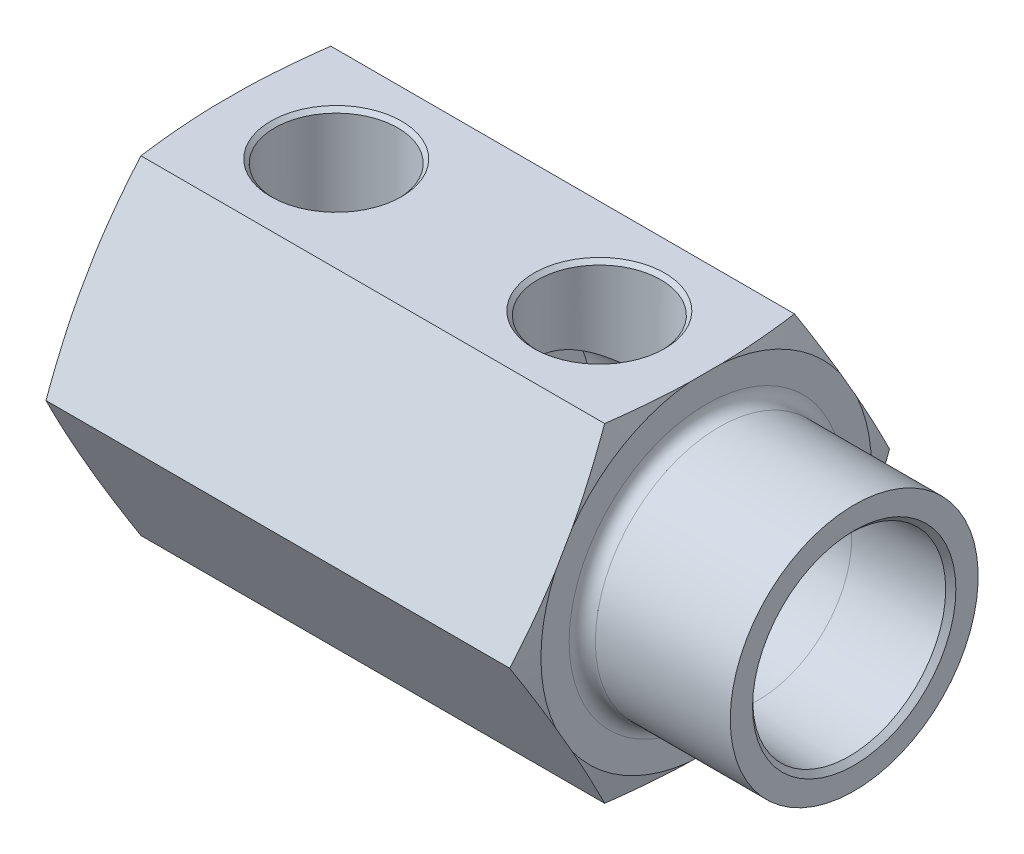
ISO-10303-21;
HEADER;
FILE_DESCRIPTION(('STEP AP214'),'2;1');
FILE_NAME('part.step','',(''),(''),'','','');
FILE_SCHEMA(('AUTOMOTIVE_DESIGN { 1 0 10303 214 1 1 1 1 }'));
ENDSEC;
DATA;
#1=APPLICATION_CONTEXT('core data for automotive mechanical design processes');
#2=APPLICATION_PROTOCOL_DEFINITION('international standard','automotive_design',2000,#1);
#3=PRODUCT_CONTEXT('',#1,'mechanical');
#4=PRODUCT('Part','Part','',(#3));
#5=PRODUCT_RELATED_PRODUCT_CATEGORY('part','',(#4));
#6=PRODUCT_DEFINITION_FORMATION('','',#4);
#7=PRODUCT_DEFINITION_CONTEXT('part definition',#1,'design');
#8=PRODUCT_DEFINITION('design','',#6,#7);
#9=PRODUCT_DEFINITION_SHAPE('','',#8);
#10=(LENGTH_UNIT() NAMED_UNIT(*) SI_UNIT(.MILLI.,.METRE.));
#11=(NAMED_UNIT(*) PLANE_ANGLE_UNIT() SI_UNIT($,.RADIAN.));
#12=(NAMED_UNIT(*) SI_UNIT($,.STERADIAN.) SOLID_ANGLE_UNIT());
#13=UNCERTAINTY_MEASURE_WITH_UNIT(LENGTH_MEASURE(1.E-05),#10,'distance_accuracy_value','');
#14=(GEOMETRIC_REPRESENTATION_CONTEXT(3) GLOBAL_UNCERTAINTY_ASSIGNED_CONTEXT((#13)) GLOBAL_UNIT_ASSIGNED_CONTEXT((#10,
#11,#12)) REPRESENTATION_CONTEXT('',''));
#15=CARTESIAN_POINT('',(0.,0.,0.));
#16=DIRECTION('',(0.,0.,1.));
#17=DIRECTION('',(1.,0.,0.));
#18=AXIS2_PLACEMENT_3D('',#15,#16,#17);
#19=CARTESIAN_POINT('',(25.74925,9.03882464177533,9.14729264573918));
#20=DIRECTION('',(1.,0.,0.));
#21=DIRECTION('',(0.,-1.,0.));
#22=AXIS2_PLACEMENT_3D('',#19,#20,#21);
#23=PLANE('',#22);
#24=CARTESIAN_POINT('',(25.74925,0.,0.));
#25=DIRECTION('',(-1.,0.,0.));
#26=DIRECTION('',(0.,0.,1.));
#27=AXIS2_PLACEMENT_3D('',#24,#25,#26);
#28=CIRCLE('',#27,5.55625);
#29=CARTESIAN_POINT('',(25.74925,0.,5.55625));
#30=VERTEX_POINT('',#29);
#31=EDGE_CURVE('E429',#30,#30,#28,.F.);
#32=ORIENTED_EDGE('',*,*,#31,.F.);
#33=EDGE_LOOP('',(#32));
#34=FACE_BOUND('',#33,.T.);
#35=CARTESIAN_POINT('',(25.74925,0.,0.));
#36=DIRECTION('',(-1.,0.,0.));
#37=DIRECTION('',(0.,0.,1.));
#38=AXIS2_PLACEMENT_3D('',#35,#36,#37);
#39=CIRCLE('',#38,9.03882464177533);
#40=CARTESIAN_POINT('',(25.74925,0.,9.03882464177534));
#41=VERTEX_POINT('',#40);
#42=EDGE_CURVE('E765',#41,#41,#39,.T.);
#43=ORIENTED_EDGE('',*,*,#42,.F.);
#44=EDGE_LOOP('',(#43));
#45=FACE_BOUND('',#44,.T.);
#46=ADVANCED_FACE('F25',(#34,#45),#23,.T.);
#47=CARTESIAN_POINT('',(51.038125,0.,0.));
#48=DIRECTION('',(-1.,0.,0.));
#49=DIRECTION('',(0.,0.,1.));
#50=AXIS2_PLACEMENT_3D('',#47,#48,#49);
#51=CYLINDRICAL_SURFACE('',#50,9.03882464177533);
#52=CARTESIAN_POINT('',(29.77642,9.03882464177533,0.));
#53=CARTESIAN_POINT('',(29.7764199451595,9.03882469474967,-0.14961021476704));
#54=CARTESIAN_POINT('',(29.7820762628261,9.03510228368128,-0.299219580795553));
#55=CARTESIAN_POINT('',(29.8046176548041,9.02030391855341,-0.597279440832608));
#56=CARTESIAN_POINT('',(29.8215071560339,9.00922506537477,-0.745729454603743));
#57=CARTESIAN_POINT('',(29.8662927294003,8.97996689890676,-1.04043296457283));
#58=CARTESIAN_POINT('',(29.8942024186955,8.96177880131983,-1.18668351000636));
#59=CARTESIAN_POINT('',(29.9606449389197,8.91872925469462,-1.47580316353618));
#60=CARTESIAN_POINT('',(29.9991822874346,8.89386496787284,-1.61867080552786));
#61=CARTESIAN_POINT('',(30.0861365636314,8.83818432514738,-1.89925929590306));
#62=CARTESIAN_POINT('',(30.1344967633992,8.80740219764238,-2.03700455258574));
#63=CARTESIAN_POINT('',(30.2406839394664,8.74044641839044,-2.30746464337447));
#64=CARTESIAN_POINT('',(30.2985145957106,8.70427067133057,-2.44017749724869));
#65=CARTESIAN_POINT('',(30.4853038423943,8.58874763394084,-2.82964660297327));
#66=CARTESIAN_POINT('',(30.6276557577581,8.50234160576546,-3.07803856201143));
#67=CARTESIAN_POINT('',(30.9568420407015,8.30918632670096,-3.56834468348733));
#68=CARTESIAN_POINT('',(31.1464080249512,8.20133806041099,-3.80796316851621));
#69=CARTESIAN_POINT('',(31.558318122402,7.97894585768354,-4.25428315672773));
#70=CARTESIAN_POINT('',(31.7807057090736,7.86439316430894,-4.4609402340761));
#71=CARTESIAN_POINT('',(32.1544228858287,7.68590270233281,-4.75851099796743));
#72=CARTESIAN_POINT('',(32.2959795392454,7.6210669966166,-4.86138756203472));
#73=CARTESIAN_POINT('',(32.5885601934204,7.49417245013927,-5.05480828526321));
#74=CARTESIAN_POINT('',(32.7395858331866,7.43211409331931,-5.14535030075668));
#75=CARTESIAN_POINT('',(33.0505170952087,7.31297555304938,-5.31331763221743));
#76=CARTESIAN_POINT('',(33.2104173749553,7.25589242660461,-5.39075072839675));
#77=CARTESIAN_POINT('',(33.5385675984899,7.14903301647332,-5.53168153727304));
#78=CARTESIAN_POINT('',(33.7068141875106,7.09925382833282,-5.5951847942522));
#79=CARTESIAN_POINT('',(34.0245604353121,7.01632048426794,-5.69871102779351));
#80=CARTESIAN_POINT('',(34.1730147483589,6.98178906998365,-5.74083681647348));
#81=CARTESIAN_POINT('',(34.4743127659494,6.9212725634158,-5.81365498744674));
#82=CARTESIAN_POINT('',(34.6271528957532,6.89528071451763,-5.84435641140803));
#83=CARTESIAN_POINT('',(34.9358065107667,6.85314869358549,-5.89370528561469));
#84=CARTESIAN_POINT('',(35.0916134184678,6.8369888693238,-5.91237678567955));
#85=CARTESIAN_POINT('',(35.4049566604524,6.81533750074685,-5.93732314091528));
#86=CARTESIAN_POINT('',(35.5624928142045,6.80984485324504,-5.94359927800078));
#87=CARTESIAN_POINT('',(35.8657734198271,6.80984245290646,-5.94360066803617));
#88=CARTESIAN_POINT('',(36.0115191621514,6.81454250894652,-5.93822892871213));
#89=CARTESIAN_POINT('',(36.3016287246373,6.83310187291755,-5.91686307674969));
#90=CARTESIAN_POINT('',(36.4459925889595,6.84696088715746,-5.90086930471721));
#91=CARTESIAN_POINT('',(36.7322829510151,6.88320089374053,-5.85855504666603));
#92=CARTESIAN_POINT('',(36.8742062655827,6.90559224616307,-5.83222200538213));
#93=CARTESIAN_POINT('',(37.1544706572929,6.95791816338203,-5.76969519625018));
#94=CARTESIAN_POINT('',(37.2928098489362,6.98785661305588,-5.73349634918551));
#95=CARTESIAN_POINT('',(37.6985639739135,7.08663142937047,-5.61167226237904));
#96=CARTESIAN_POINT('',(37.9597145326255,7.16484911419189,-5.5123590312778));
#97=CARTESIAN_POINT('',(38.4610624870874,7.33699976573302,-5.28105482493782));
#98=CARTESIAN_POINT('',(38.7012561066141,7.43093555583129,-5.14905797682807));
#99=CARTESIAN_POINT('',(39.1938855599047,7.64100012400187,-4.83286753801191));
#100=CARTESIAN_POINT('',(39.4427121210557,7.7583401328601,-4.64380576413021));
#101=CARTESIAN_POINT('',(39.7916048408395,7.93358158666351,-4.3327712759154));
#102=CARTESIAN_POINT('',(39.9039244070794,7.99191353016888,-4.22442207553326));
#103=CARTESIAN_POINT('',(40.1200873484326,8.10716876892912,-3.99877394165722));
#104=CARTESIAN_POINT('',(40.2239290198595,8.16409177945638,-3.88147321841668));
#105=CARTESIAN_POINT('',(40.436438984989,8.28310240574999,-3.62129668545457));
#106=CARTESIAN_POINT('',(40.5437576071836,8.34480177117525,-3.47713650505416));
#107=CARTESIAN_POINT('',(40.7456853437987,8.46313142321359,-3.17829626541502));
#108=CARTESIAN_POINT('',(40.8402999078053,8.5197638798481,-3.02362076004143));
#109=CARTESIAN_POINT('',(41.0157379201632,8.62634035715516,-2.70460000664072));
#110=CARTESIAN_POINT('',(41.0965723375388,8.67628969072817,-2.54026259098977));
#111=CARTESIAN_POINT('',(41.2433722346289,8.76801595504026,-2.20290134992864));
#112=CARTESIAN_POINT('',(41.3093417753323,8.80979511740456,-2.02987991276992));
#113=CARTESIAN_POINT('',(41.4156914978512,8.87768339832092,-1.70581168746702));
#114=CARTESIAN_POINT('',(41.4584991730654,8.9052412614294,-1.55586135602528));
#115=CARTESIAN_POINT('',(41.5323695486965,8.95302080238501,-1.25196336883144));
#116=CARTESIAN_POINT('',(41.5634346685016,8.97324399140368,-1.0980165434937));
#117=CARTESIAN_POINT('',(41.6133245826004,9.00581211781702,-0.787439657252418));
#118=CARTESIAN_POINT('',(41.6321582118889,9.01816274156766,-0.630811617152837));
#119=CARTESIAN_POINT('',(41.6573055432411,9.03466870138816,-0.316120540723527));
#120=CARTESIAN_POINT('',(41.6636195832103,9.03882425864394,-0.158057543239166));
#121=CARTESIAN_POINT('',(41.6636203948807,9.038825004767,0.149749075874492));
#122=CARTESIAN_POINT('',(41.6579534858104,9.03509555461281,0.29949325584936));
#123=CARTESIAN_POINT('',(41.6353758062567,9.02027336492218,0.597756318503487));
#124=CARTESIAN_POINT('',(41.6184655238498,9.00918094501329,0.74627525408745));
#125=CARTESIAN_POINT('',(41.573649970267,8.9799034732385,1.04096995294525));
#126=CARTESIAN_POINT('',(41.5457416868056,8.96171647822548,1.18714506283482));
#127=CARTESIAN_POINT('',(41.4793262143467,8.91868483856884,1.47605834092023));
#128=CARTESIAN_POINT('',(41.4408187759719,8.89384003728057,1.61879642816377));
#129=CARTESIAN_POINT('',(41.3539086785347,8.83818767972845,1.89924240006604));
#130=CARTESIAN_POINT('',(41.3055549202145,8.80740962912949,2.03697132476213));
#131=CARTESIAN_POINT('',(41.1993827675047,8.74046319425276,2.30740009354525));
#132=CARTESIAN_POINT('',(41.1415606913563,8.70429271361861,2.44009795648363));
#133=CARTESIAN_POINT('',(40.9547706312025,8.58876851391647,2.82958661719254));
#134=CARTESIAN_POINT('',(40.8124041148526,8.50235308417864,3.07800984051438));
#135=CARTESIAN_POINT('',(40.4832043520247,8.3091902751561,3.5683342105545));
#136=CARTESIAN_POINT('',(40.2936445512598,8.20134592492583,3.80794426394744));
#137=CARTESIAN_POINT('',(39.8817447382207,7.97895712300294,4.25426367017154));
#138=CARTESIAN_POINT('',(39.6593584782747,7.86440335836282,4.46092573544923));
#139=CARTESIAN_POINT('',(39.2855576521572,7.68587508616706,4.75855559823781));
#140=CARTESIAN_POINT('',(39.1439298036,7.62100902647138,4.86147595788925));
#141=CARTESIAN_POINT('',(38.8512739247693,7.49408446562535,5.05494236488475));
#142=CARTESIAN_POINT('',(38.7002438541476,7.43202657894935,5.14548571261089));
#143=CARTESIAN_POINT('',(38.2340813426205,7.2534293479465,5.39724476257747));
#144=CARTESIAN_POINT('',(37.9051218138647,7.14408502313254,5.53919448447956));
#145=CARTESIAN_POINT('',(37.3144929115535,6.98998723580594,5.73160254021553));
#146=CARTESIAN_POINT('',(37.0600493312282,6.93571363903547,5.79657702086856));
#147=CARTESIAN_POINT('',(36.6707398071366,6.8746870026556,5.86855681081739));
#148=CARTESIAN_POINT('',(36.539744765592,6.85774453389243,5.88830054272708));
#149=CARTESIAN_POINT('',(36.2759626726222,6.83124157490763,5.91903035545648));
#150=CARTESIAN_POINT('',(36.1431756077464,6.82168114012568,5.93001637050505));
#151=CARTESIAN_POINT('',(35.8763288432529,6.81032746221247,5.94305168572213));
#152=CARTESIAN_POINT('',(35.7422662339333,6.80856361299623,5.94506716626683));
#153=CARTESIAN_POINT('',(35.4744432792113,6.81295452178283,5.9400347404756));
#154=CARTESIAN_POINT('',(35.3406829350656,6.81910931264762,5.93298679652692));
#155=CARTESIAN_POINT('',(35.0744423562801,6.83908712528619,5.90994669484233));
#156=CARTESIAN_POINT('',(34.9419628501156,6.85291427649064,5.89394972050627));
#157=CARTESIAN_POINT('',(34.6792684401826,6.88768050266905,5.85328224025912));
#158=CARTESIAN_POINT('',(34.5490545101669,6.90862255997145,5.82860809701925));
#159=CARTESIAN_POINT('',(34.1732015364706,6.97910024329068,5.74436936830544));
#160=CARTESIAN_POINT('',(33.9315833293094,7.03721668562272,5.67358967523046));
#161=CARTESIAN_POINT('',(33.4635217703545,7.17043540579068,5.50424668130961));
#162=CARTESIAN_POINT('',(33.2370834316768,7.24554325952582,5.40567425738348));
#163=CARTESIAN_POINT('',(32.7573656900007,7.42240415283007,5.160946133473));
#164=CARTESIAN_POINT('',(32.5077928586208,7.52648099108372,5.0092144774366));
#165=CARTESIAN_POINT('',(32.0346872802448,7.74022172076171,4.6721693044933));
#166=CARTESIAN_POINT('',(31.8111860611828,7.84989215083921,4.48681580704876));
#167=CARTESIAN_POINT('',(31.4761184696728,8.02328680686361,4.16487442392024));
#168=CARTESIAN_POINT('',(31.3553762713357,8.08794372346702,4.03819474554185));
#169=CARTESIAN_POINT('',(31.1249569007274,8.21457835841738,3.77392259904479));
#170=CARTESIAN_POINT('',(31.0152763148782,8.27655689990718,3.63633352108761));
#171=CARTESIAN_POINT('',(30.8078039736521,8.39622912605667,3.35076958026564));
#172=CARTESIAN_POINT('',(30.7100093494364,8.45392384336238,3.20279723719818));
#173=CARTESIAN_POINT('',(30.5272544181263,8.56349436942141,2.89711104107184));
#174=CARTESIAN_POINT('',(30.4422902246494,8.61537193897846,2.73940015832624));
#175=CARTESIAN_POINT('',(30.3016159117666,8.70233607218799,2.4470722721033));
#176=CARTESIAN_POINT('',(30.2434396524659,8.7387175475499,2.31402208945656));
#177=CARTESIAN_POINT('',(30.1366126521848,8.80605966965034,2.04283411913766));
#178=CARTESIAN_POINT('',(30.0879599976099,8.83702140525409,1.90469736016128));
#179=CARTESIAN_POINT('',(30.0008110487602,8.89281747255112,1.62435592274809));
#180=CARTESIAN_POINT('',(29.9622945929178,8.9176639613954,1.4821599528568));
#181=CARTESIAN_POINT('',(29.8957941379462,8.96074410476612,1.1943916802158));
#182=CARTESIAN_POINT('',(29.8678061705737,8.9789802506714,1.04882067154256));
#183=CARTESIAN_POINT('',(29.8224422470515,9.00861219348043,0.753379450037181));
#184=CARTESIAN_POINT('',(29.8052090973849,9.01991590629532,0.603477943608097));
#185=CARTESIAN_POINT('',(29.78219669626,9.03502295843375,0.302384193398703));
#186=CARTESIAN_POINT('',(29.7764200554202,9.03882458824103,0.151191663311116));
#187=CARTESIAN_POINT('',(29.77642,9.03882464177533,0.));
#188=B_SPLINE_CURVE_WITH_KNOTS('',3,(#52,#53,#54,#55,#56,#57,#58,#59,#60,#61,#62,#63,#64,#65,
#66,#67,#68,#69,#70,#71,#72,#73,#74,#75,#76,#77,#78,#79,#80,#81,#82,#83,#84,#85,#86,#87,#88,#89,
#90,#91,#92,#93,#94,#95,#96,#97,#98,#99,#100,#101,#102,#103,#104,#105,#106,#107,#108,#109,#110,
#111,#112,#113,#114,#115,#116,#117,#118,#119,#120,#121,#122,#123,#124,#125,#126,#127,#128,#129,
#130,#131,#132,#133,#134,#135,#136,#137,#138,#139,#140,#141,#142,#143,#144,#145,#146,#147,#148,
#149,#150,#151,#152,#153,#154,#155,#156,#157,#158,#159,#160,#161,#162,#163,#164,#165,#166,#167,
#168,#169,#170,#171,#172,#173,#174,#175,#176,#177,#178,#179,#180,#181,#182,#183,#184,#185,#186,
#187),.UNSPECIFIED.,.T.,.F.,(4,2,2,2,2,2,2,2,2,2,2,2,2,2,2,2,2,2,2,2,2,2,2,2,2,2,2,2,2,2,2,2,2,
2,2,2,2,2,2,2,2,2,2,2,2,2,2,2,2,2,2,2,2,2,2,2,2,2,2,2,2,2,2,2,2,2,2,4),(0.,0.44867737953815,
0.897531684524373,1.34694236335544,1.79654437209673,2.24362016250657,2.6908700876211,
3.58440261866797,4.55297128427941,5.52283456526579,6.08212380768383,6.6415101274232,
7.20056327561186,7.75939350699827,8.23314872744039,8.70652819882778,9.17895834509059,
9.65133963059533,10.0884145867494,10.5254755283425,10.9630688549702,11.4008878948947,
12.2674539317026,13.1341757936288,14.1315019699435,14.630962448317,15.1305230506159,
15.6998178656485,16.268867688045,16.837462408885,17.4059016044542,17.8803582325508,
18.3547170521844,18.8287328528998,19.3027358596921,19.7518223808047,20.2008894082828,
20.6500795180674,21.0992801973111,21.5463021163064,21.993498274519,22.8871382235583,
23.8556653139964,24.8255701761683,25.3850696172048,25.9446908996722,27.060853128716,
27.8618668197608,28.262083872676,28.6623039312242,29.0640315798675,29.4657608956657,
29.8677066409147,30.2698210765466,31.0418771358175,31.8141869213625,32.7411675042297,
33.6692576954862,34.2283800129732,34.7873292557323,35.3461433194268,35.9047877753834,
36.3534406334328,36.8020032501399,37.2496667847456,37.6971614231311,38.1504782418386,
38.6038983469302),.UNSPECIFIED.);
#189=CARTESIAN_POINT('',(29.77642,9.03882464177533,0.));
#190=VERTEX_POINT('',#189);
#191=EDGE_CURVE('E428',#190,#190,#188,.T.);
#192=ORIENTED_EDGE('',*,*,#191,.F.);
#193=EDGE_LOOP('',(#192));
#194=FACE_BOUND('',#193,.T.);
#195=ORIENTED_EDGE('',*,*,#42,.T.);
#196=EDGE_LOOP('',(#195));
#197=FACE_BOUND('',#196,.T.);
#198=CARTESIAN_POINT('',(51.038125,0.,0.));
#199=DIRECTION('',(-1.,0.,0.));
#200=DIRECTION('',(0.,1.,0.));
#201=AXIS2_PLACEMENT_3D('',#198,#199,#200);
#202=CIRCLE('',#201,9.03882464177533);
#203=CARTESIAN_POINT('',(51.038125,9.03882464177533,0.));
#204=VERTEX_POINT('',#203);
#205=EDGE_CURVE('E425',#204,#204,#202,.T.);
#206=ORIENTED_EDGE('',*,*,#205,.F.);
#207=EDGE_LOOP('',(#206));
#208=FACE_BOUND('',#207,.T.);
#209=ADVANCED_FACE('F732',(#194,#197,#208),#51,.F.);
#210=CARTESIAN_POINT('',(25.74925,0.,0.));
#211=DIRECTION('',(-1.,0.,0.));
#212=DIRECTION('',(0.,0.,1.));
#213=AXIS2_PLACEMENT_3D('',#210,#211,#212);
#214=CYLINDRICAL_SURFACE('',#213,5.55625);
#215=ORIENTED_EDGE('',*,*,#31,.T.);
#216=EDGE_LOOP('',(#215));
#217=FACE_BOUND('',#216,.T.);
#218=CARTESIAN_POINT('',(12.4305808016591,0.,5.55625));
#219=CARTESIAN_POINT('',(12.4305821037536,-0.0734747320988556,5.55624966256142));
#220=CARTESIAN_POINT('',(12.434447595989,-0.146955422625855,5.55478591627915));
#221=CARTESIAN_POINT('',(12.4495818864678,-0.29302083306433,5.54900069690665));
#222=CARTESIAN_POINT('',(12.4608524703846,-0.365605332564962,5.54467853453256));
#223=CARTESIAN_POINT('',(12.5047133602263,-0.581643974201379,5.52761133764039));
#224=CARTESIAN_POINT('',(12.5473420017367,-0.72276757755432,5.51076770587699));
#225=CARTESIAN_POINT('',(12.6387953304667,-0.965392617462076,5.47279703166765));
#226=CARTESIAN_POINT('',(12.6840529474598,-1.0686506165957,5.45349342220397));
#227=CARTESIAN_POINT('',(12.7819601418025,-1.27061179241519,5.41000084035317));
#228=CARTESIAN_POINT('',(12.834615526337,-1.36931130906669,5.38580802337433));
#229=CARTESIAN_POINT('',(12.9450255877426,-1.56286060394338,5.33286839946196));
#230=CARTESIAN_POINT('',(13.0027936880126,-1.65769923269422,5.30410943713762));
#231=CARTESIAN_POINT('',(13.1216522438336,-1.84384911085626,5.24230300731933));
#232=CARTESIAN_POINT('',(13.1827438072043,-1.93515916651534,5.20925410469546));
#233=CARTESIAN_POINT('',(13.366176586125,-2.2001706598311,5.10555072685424));
#234=CARTESIAN_POINT('',(13.4914670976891,-2.36956590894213,5.02904480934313));
#235=CARTESIAN_POINT('',(13.7443875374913,-2.69865891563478,4.86038152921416));
#236=CARTESIAN_POINT('',(13.8720192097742,-2.85834902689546,4.76821203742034));
#237=CARTESIAN_POINT('',(14.1259179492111,-3.16832360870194,4.56810807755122));
#238=CARTESIAN_POINT('',(14.252186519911,-3.31861956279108,4.46019341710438));
#239=CARTESIAN_POINT('',(14.5006572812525,-3.60956331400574,4.22818608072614));
#240=CARTESIAN_POINT('',(14.6228618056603,-3.75021669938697,4.10410289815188));
#241=CARTESIAN_POINT('',(14.9168731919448,-4.08481118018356,3.77675794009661));
#242=CARTESIAN_POINT('',(15.0849550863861,-4.27267506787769,3.5637169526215));
#243=CARTESIAN_POINT('',(15.3983535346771,-4.61957266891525,3.1007850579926));
#244=CARTESIAN_POINT('',(15.5437068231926,-4.77865296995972,2.85095490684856));
#245=CARTESIAN_POINT('',(15.7753249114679,-5.03068620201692,2.37096937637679));
#246=CARTESIAN_POINT('',(15.8675933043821,-5.13051088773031,2.14740345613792));
#247=CARTESIAN_POINT('',(15.9865316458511,-5.25881541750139,1.79783475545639));
#248=CARTESIAN_POINT('',(16.0229281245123,-5.29800553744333,1.67896830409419));
#249=CARTESIAN_POINT('',(16.0886347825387,-5.36867014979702,1.43706860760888));
#250=CARTESIAN_POINT('',(16.1179463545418,-5.40014615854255,1.31403618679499));
#251=CARTESIAN_POINT('',(16.1827445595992,-5.46967187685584,0.996696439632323));
#252=CARTESIAN_POINT('',(16.2129329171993,-5.50200091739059,0.799984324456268));
#253=CARTESIAN_POINT('',(16.2533663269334,-5.54528563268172,0.402145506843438));
#254=CARTESIAN_POINT('',(16.2636115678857,-5.55624150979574,0.201018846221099));
#255=CARTESIAN_POINT('',(16.2636253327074,-5.55625536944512,-0.127129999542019));
#256=CARTESIAN_POINT('',(16.2595362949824,-5.55188216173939,-0.254216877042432));
#257=CARTESIAN_POINT('',(16.2432853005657,-5.53449324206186,-0.50731884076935));
#258=CARTESIAN_POINT('',(16.2311219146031,-5.52147599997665,-0.633333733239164));
#259=CARTESIAN_POINT('',(16.198975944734,-5.48704782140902,-0.883260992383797));
#260=CARTESIAN_POINT('',(16.1789888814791,-5.46563207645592,-1.00717211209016));
#261=CARTESIAN_POINT('',(16.1316077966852,-5.41481026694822,-1.25194954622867));
#262=CARTESIAN_POINT('',(16.1042103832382,-5.38540054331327,-1.37281443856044));
#263=CARTESIAN_POINT('',(16.0427534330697,-5.31933803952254,-1.60984023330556));
#264=CARTESIAN_POINT('',(16.0087416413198,-5.28273714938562,-1.72602804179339));
#265=CARTESIAN_POINT('',(15.9345222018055,-5.20272906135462,-1.95400655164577));
#266=CARTESIAN_POINT('',(15.8943122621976,-5.15931934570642,-2.06579560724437));
#267=CARTESIAN_POINT('',(15.7653082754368,-5.01975797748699,-2.39380643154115));
#268=CARTESIAN_POINT('',(15.668089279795,-4.91421974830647,-2.60286200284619));
#269=CARTESIAN_POINT('',(15.4877723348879,-4.7172304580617,-2.94036757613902));
#270=CARTESIAN_POINT('',(15.4090572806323,-4.63090632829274,-3.07431559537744));
#271=CARTESIAN_POINT('',(15.244523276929,-4.449464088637,-3.3315043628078));
#272=CARTESIAN_POINT('',(15.1587037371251,-4.35434524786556,-3.45474421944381));
#273=CARTESIAN_POINT('',(14.981136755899,-4.15613898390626,-3.69083586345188));
#274=CARTESIAN_POINT('',(14.8893718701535,-4.05302791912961,-3.80365448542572));
#275=CARTESIAN_POINT('',(14.7014926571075,-3.8399684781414,-4.01863828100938));
#276=CARTESIAN_POINT('',(14.6053787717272,-3.7300207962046,-4.12080453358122));
#277=CARTESIAN_POINT('',(14.3844008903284,-3.47418087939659,-4.34020448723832));
#278=CARTESIAN_POINT('',(14.2586152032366,-3.32643165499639,-4.45434929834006));
#279=CARTESIAN_POINT('',(14.004696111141,-3.02151273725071,-4.66657490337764));
#280=CARTESIAN_POINT('',(13.8765610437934,-2.86433617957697,-4.76464379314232));
#281=CARTESIAN_POINT('',(13.6215843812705,-2.54082268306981,-4.94472869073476));
#282=CARTESIAN_POINT('',(13.4947403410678,-2.3745098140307,-5.02678450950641));
#283=CARTESIAN_POINT('',(13.2467394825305,-2.03113427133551,-5.17507592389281));
#284=CARTESIAN_POINT('',(13.1255752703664,-1.8540863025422,-5.24133257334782));
#285=CARTESIAN_POINT('',(12.9309991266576,-1.54044994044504,-5.3401640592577));
#286=CARTESIAN_POINT('',(12.8540644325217,-1.40738697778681,-5.37690449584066));
#287=CARTESIAN_POINT('',(12.712439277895,-1.1327266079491,-5.44138923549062));
#288=CARTESIAN_POINT('',(12.6477341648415,-0.991139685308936,-5.46914433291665));
#289=CARTESIAN_POINT('',(12.5499837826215,-0.727975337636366,-5.50961773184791));
#290=CARTESIAN_POINT('',(12.5131825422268,-0.608139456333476,-5.52424157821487));
#291=CARTESIAN_POINT('',(12.45840547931,-0.363684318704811,-5.5456823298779));
#292=CARTESIAN_POINT('',(12.4403726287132,-0.239080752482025,-5.55252289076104));
#293=CARTESIAN_POINT('',(12.4268655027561,0.0125055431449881,-5.557667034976));
#294=CARTESIAN_POINT('',(12.4315528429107,0.139498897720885,-5.55590945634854));
#295=CARTESIAN_POINT('',(12.4627461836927,0.390456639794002,-5.54394656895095));
#296=CARTESIAN_POINT('',(12.4893030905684,0.514413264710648,-5.53372155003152));
#297=CARTESIAN_POINT('',(12.5741094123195,0.808835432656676,-5.49984089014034));
#298=CARTESIAN_POINT('',(12.6411004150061,0.97621379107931,-5.47228799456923));
#299=CARTESIAN_POINT('',(12.7943625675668,1.29935542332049,-5.40472641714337));
#300=CARTESIAN_POINT('',(12.8807176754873,1.45506405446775,-5.36466318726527));
#301=CARTESIAN_POINT('',(13.0709301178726,1.76912432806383,-5.26982878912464));
#302=CARTESIAN_POINT('',(13.1756387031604,1.92666750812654,-5.21412879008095));
#303=CARTESIAN_POINT('',(13.3906664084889,2.23298998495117,-5.09047725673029));
#304=CARTESIAN_POINT('',(13.5009909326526,2.38176053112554,-5.02251375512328));
#305=CARTESIAN_POINT('',(13.72367380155,2.67189311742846,-4.87436661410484));
#306=CARTESIAN_POINT('',(13.836034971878,2.81324360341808,-4.7941646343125));
#307=CARTESIAN_POINT('',(14.0600899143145,3.08869678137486,-4.62150082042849));
#308=CARTESIAN_POINT('',(14.1717839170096,3.22280212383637,-4.5290435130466));
#309=CARTESIAN_POINT('',(14.4025044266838,3.49541690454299,-4.32270228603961));
#310=CARTESIAN_POINT('',(14.5212906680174,3.63324346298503,-4.20764058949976));
#311=CARTESIAN_POINT('',(14.7535734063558,3.89950631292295,-3.96214135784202));
#312=CARTESIAN_POINT('',(14.8670681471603,4.02793949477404,-3.83169876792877));
#313=CARTESIAN_POINT('',(15.0860940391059,4.27364934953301,-3.55553883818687));
#314=CARTESIAN_POINT('',(15.1916498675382,4.39096091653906,-3.40987250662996));
#315=CARTESIAN_POINT('',(15.3926467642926,4.61294781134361,-3.10298276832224));
#316=CARTESIAN_POINT('',(15.4880955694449,4.71763281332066,-2.94177144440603));
#317=CARTESIAN_POINT('',(15.6869179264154,4.93471833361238,-2.56474644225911));
#318=CARTESIAN_POINT('',(15.7870346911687,5.04332160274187,-2.34491881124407));
#319=CARTESIAN_POINT('',(15.918462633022,5.18540348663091,-1.9997585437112));
#320=CARTESIAN_POINT('',(15.9591479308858,5.22929416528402,-1.88213324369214));
#321=CARTESIAN_POINT('',(16.0336165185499,5.30951434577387,-1.64223499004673));
#322=CARTESIAN_POINT('',(16.0674034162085,5.34584780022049,-1.51996450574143));
#323=CARTESIAN_POINT('',(16.1244429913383,5.40712226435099,-1.28386375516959));
#324=CARTESIAN_POINT('',(16.1484097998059,5.43283763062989,-1.17040617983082));
#325=CARTESIAN_POINT('',(16.1898145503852,5.4772333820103,-0.940993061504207));
#326=CARTESIAN_POINT('',(16.2072554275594,5.49591692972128,-0.825038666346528));
#327=CARTESIAN_POINT('',(16.2353012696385,5.52594919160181,-0.591338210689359));
#328=CARTESIAN_POINT('',(16.2459049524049,5.53729653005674,-0.473591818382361));
#329=CARTESIAN_POINT('',(16.2600633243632,5.55244586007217,-0.237231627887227));
#330=CARTESIAN_POINT('',(16.2636203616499,5.55625036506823,-0.118618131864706));
#331=CARTESIAN_POINT('',(16.2636196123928,5.55624960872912,0.127131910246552));
#332=CARTESIAN_POINT('',(16.2595328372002,5.55187855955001,0.254269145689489));
#333=CARTESIAN_POINT('',(16.243278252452,5.53448560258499,0.507430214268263));
#334=CARTESIAN_POINT('',(16.2311099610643,5.52146317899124,0.633453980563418));
#335=CARTESIAN_POINT('',(16.1989585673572,5.48702922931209,0.883368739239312));
#336=CARTESIAN_POINT('',(16.1789732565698,5.46561533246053,1.00725911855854));
#337=CARTESIAN_POINT('',(16.13159809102,5.41479984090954,1.25199339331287));
#338=CARTESIAN_POINT('',(16.1042048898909,5.38539463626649,1.37283588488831));
#339=CARTESIAN_POINT('',(16.0427545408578,5.31933923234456,1.60983570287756));
#340=CARTESIAN_POINT('',(16.0087441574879,5.28273985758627,1.72601937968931));
#341=CARTESIAN_POINT('',(15.9345279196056,5.2027352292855,1.95398992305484));
#342=CARTESIAN_POINT('',(15.8943197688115,5.15932745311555,2.06577514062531));
#343=CARTESIAN_POINT('',(15.7653154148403,5.01976572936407,2.39379102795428));
#344=CARTESIAN_POINT('',(15.6680931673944,4.91422399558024,2.60285471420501));
#345=CARTESIAN_POINT('',(15.4877680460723,4.71722577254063,2.94037561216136));
#346=CARTESIAN_POINT('',(15.4090482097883,4.63089638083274,3.07433103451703));
#347=CARTESIAN_POINT('',(15.2445039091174,4.4494426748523,3.33153337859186));
#348=CARTESIAN_POINT('',(15.1586788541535,4.35431762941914,3.45477940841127));
#349=CARTESIAN_POINT('',(14.9811106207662,4.15610965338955,3.69086849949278));
#350=CARTESIAN_POINT('',(14.8893506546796,4.0530039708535,3.80367964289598));
#351=CARTESIAN_POINT('',(14.7014817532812,3.83995600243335,4.0186498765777));
#352=CARTESIAN_POINT('',(14.6053732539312,3.73001440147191,4.12081003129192));
#353=CARTESIAN_POINT('',(14.3844312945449,3.47421608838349,4.34017427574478));
#354=CARTESIAN_POINT('',(14.2586771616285,3.32650446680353,4.45429298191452));
#355=CARTESIAN_POINT('',(14.0048230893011,3.02166681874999,4.66647330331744));
#356=CARTESIAN_POINT('',(13.8767215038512,2.86453399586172,4.76452313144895));
#357=CARTESIAN_POINT('',(13.6217448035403,2.5410319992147,4.94462268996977));
#358=CARTESIAN_POINT('',(13.4948677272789,2.37468221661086,5.02670448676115));
#359=CARTESIAN_POINT('',(13.2468058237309,2.03123016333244,5.17504008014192));
#360=CARTESIAN_POINT('',(13.1256137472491,1.85414228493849,5.24131449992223));
#361=CARTESIAN_POINT('',(12.92552630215,1.53163286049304,5.34294277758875));
#362=CARTESIAN_POINT('',(12.8435978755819,1.38925827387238,5.38188849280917));
#363=CARTESIAN_POINT('',(12.6941939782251,1.09471141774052,5.44943417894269));
#364=CARTESIAN_POINT('',(12.6266951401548,0.942555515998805,5.47805092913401));
#365=CARTESIAN_POINT('',(12.5280456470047,0.65921532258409,5.51845314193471));
#366=CARTESIAN_POINT('',(12.492295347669,0.530055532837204,5.53247755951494));
#367=CARTESIAN_POINT('',(12.4556943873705,0.332903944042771,5.54665988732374));
#368=CARTESIAN_POINT('',(12.4463327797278,0.266716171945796,5.5502446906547));
#369=CARTESIAN_POINT('',(12.4337768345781,0.133687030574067,5.55503934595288));
#370=CARTESIAN_POINT('',(12.4305796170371,0.0668459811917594,5.55625030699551));
#371=CARTESIAN_POINT('',(12.4305808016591,0.,5.55625));
#372=B_SPLINE_CURVE_WITH_KNOTS('',3,(#218,#219,#220,#221,#222,#223,#224,#225,#226,#227,#228,
#229,#230,#231,#232,#233,#234,#235,#236,#237,#238,#239,#240,#241,#242,#243,#244,#245,#246,#247,
#248,#249,#250,#251,#252,#253,#254,#255,#256,#257,#258,#259,#260,#261,#262,#263,#264,#265,#266,
#267,#268,#269,#270,#271,#272,#273,#274,#275,#276,#277,#278,#279,#280,#281,#282,#283,#284,#285,
#286,#287,#288,#289,#290,#291,#292,#293,#294,#295,#296,#297,#298,#299,#300,#301,#302,#303,#304,
#305,#306,#307,#308,#309,#310,#311,#312,#313,#314,#315,#316,#317,#318,#319,#320,#321,#322,#323,
#324,#325,#326,#327,#328,#329,#330,#331,#332,#333,#334,#335,#336,#337,#338,#339,#340,#341,#342,
#343,#344,#345,#346,#347,#348,#349,#350,#351,#352,#353,#354,#355,#356,#357,#358,#359,#360,#361,
#362,#363,#364,#365,#366,#367,#368,#369,#370,#371),.UNSPECIFIED.,.T.,.F.,(4,2,2,2,2,2,2,2,2,2,2,
2,2,2,2,2,2,2,2,2,2,2,2,2,2,2,2,2,2,2,2,2,2,2,2,2,2,2,2,2,2,2,2,2,2,2,2,2,2,2,2,2,2,2,2,2,2,2,2,
2,2,2,2,2,2,2,2,2,2,2,2,2,2,2,2,2,4),(0.,0.220319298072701,0.440691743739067,0.883248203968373,
1.22597015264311,1.56896265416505,1.9128840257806,2.25692074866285,2.9284357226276,
3.60047307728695,4.27167217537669,4.94247893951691,5.92900715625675,6.91392405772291,
7.69546765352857,8.08607564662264,8.4766067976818,9.07933095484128,9.68204940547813,
10.0632255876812,10.4444692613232,10.8259315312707,11.2075687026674,11.5865470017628,
11.9656657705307,12.7232973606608,13.2558905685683,13.788528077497,14.3228061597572,
14.857030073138,15.5315459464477,16.2065590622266,16.8798719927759,17.5522825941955,
18.0257722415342,18.4986909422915,18.8760019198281,19.252163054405,19.6310038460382,
20.0107289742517,20.5547816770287,21.1012405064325,21.6919852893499,22.2833096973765,
22.875529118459,23.46753039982,24.1126011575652,24.7578845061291,25.4010711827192,
26.0437618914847,26.8348103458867,27.2303476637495,27.6256775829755,27.9816228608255,
28.3374078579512,28.6932595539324,29.0489926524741,29.4302583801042,29.8115468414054,
30.1929431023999,30.5745119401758,30.9534761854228,31.3325811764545,32.0902405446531,
32.622864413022,33.1555325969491,33.68977964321,34.2239732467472,34.8983226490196,
35.5731645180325,36.2466368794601,36.9192257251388,37.4249096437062,37.9297683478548,
38.3319980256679,38.5325342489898,38.7329767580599),.UNSPECIFIED.);
#373=CARTESIAN_POINT('',(12.4305808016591,0.,5.55625));
#374=VERTEX_POINT('',#373);
#375=EDGE_CURVE('E424',#374,#374,#372,.T.);
#376=ORIENTED_EDGE('',*,*,#375,.F.);
#377=EDGE_LOOP('',(#376));
#378=FACE_BOUND('',#377,.T.);
#379=ADVANCED_FACE('F724',(#217,#378),#214,.F.);
#380=CARTESIAN_POINT('',(59.8413661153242,0.,0.));
#381=DIRECTION('',(1.,0.,0.));
#382=DIRECTION('',(0.,0.,-1.));
#383=AXIS2_PLACEMENT_3D('',#380,#381,#382);
#384=CONICAL_SURFACE('',#383,9.31393967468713,0.0312413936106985);
#385=CARTESIAN_POINT('',(59.8413661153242,0.,0.));
#386=DIRECTION('',(-1.,0.,0.));
#387=DIRECTION('',(0.,1.,0.));
#388=AXIS2_PLACEMENT_3D('',#385,#386,#387);
#389=CIRCLE('',#388,9.31393967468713);
#390=CARTESIAN_POINT('',(59.8413661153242,9.31393967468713,0.));
#391=VERTEX_POINT('',#390);
#392=EDGE_CURVE('E421',#391,#391,#389,.T.);
#393=ORIENTED_EDGE('',*,*,#392,.F.);
#394=EDGE_LOOP('',(#393));
#395=FACE_BOUND('',#394,.T.);
#396=ORIENTED_EDGE('',*,*,#205,.T.);
#397=EDGE_LOOP('',(#396));
#398=FACE_BOUND('',#397,.T.);
#399=ADVANCED_FACE('F716',(#395,#398),#384,.F.);
#400=CARTESIAN_POINT('',(35.72002,6.80457338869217,0.));
#401=DIRECTION('',(0.,1.,0.));
#402=DIRECTION('',(0.,0.,1.));
#403=AXIS2_PLACEMENT_3D('',#400,#401,#402);
#404=CYLINDRICAL_SURFACE('',#403,5.94360000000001);
#405=CARTESIAN_POINT('',(35.72002,15.50162,0.));
#406=DIRECTION('',(0.,-1.,0.));
#407=DIRECTION('',(1.,0.,0.));
#408=AXIS2_PLACEMENT_3D('',#405,#406,#407);
#409=CIRCLE('',#408,5.94359999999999);
#410=CARTESIAN_POINT('',(41.66362,15.50162,0.));
#411=VERTEX_POINT('',#410);
#412=EDGE_CURVE('E169',#411,#411,#409,.T.);
#413=ORIENTED_EDGE('',*,*,#412,.F.);
#414=EDGE_LOOP('',(#413));
#415=FACE_BOUND('',#414,.T.);
#416=ORIENTED_EDGE('',*,*,#191,.T.);
#417=EDGE_LOOP('',(#416));
#418=FACE_BOUND('',#417,.T.);
#419=ADVANCED_FACE('F709',(#415,#418),#404,.F.);
#420=CARTESIAN_POINT('',(10.32002,-15.50162,0.));
#421=DIRECTION('',(0.,1.,0.));
#422=DIRECTION('',(0.,0.,1.));
#423=AXIS2_PLACEMENT_3D('',#420,#421,#422);
#424=CYLINDRICAL_SURFACE('',#423,5.9436);
#425=ORIENTED_EDGE('',*,*,#375,.T.);
#426=EDGE_LOOP('',(#425));
#427=FACE_BOUND('',#426,.T.);
#428=CARTESIAN_POINT('',(10.32002,-15.50162,0.));
#429=DIRECTION('',(0.,1.,0.));
#430=DIRECTION('',(1.,0.,0.));
#431=AXIS2_PLACEMENT_3D('',#428,#429,#430);
#432=CIRCLE('',#431,5.9436);
#433=CARTESIAN_POINT('',(16.26362,-15.50162,0.));
#434=VERTEX_POINT('',#433);
#435=EDGE_CURVE('E413',#434,#434,#432,.T.);
#436=ORIENTED_EDGE('',*,*,#435,.F.);
#437=EDGE_LOOP('',(#436));
#438=FACE_BOUND('',#437,.T.);
#439=CARTESIAN_POINT('',(10.32002,15.50162,0.));
#440=DIRECTION('',(0.,-1.,0.));
#441=DIRECTION('',(1.,0.,0.));
#442=AXIS2_PLACEMENT_3D('',#439,#440,#441);
#443=CIRCLE('',#442,5.9436);
#444=CARTESIAN_POINT('',(16.26362,15.50162,0.));
#445=VERTEX_POINT('',#444);
#446=EDGE_CURVE('E418',#445,#445,#443,.T.);
#447=ORIENTED_EDGE('',*,*,#446,.F.);
#448=EDGE_LOOP('',(#447));
#449=FACE_BOUND('',#448,.T.);
#450=ADVANCED_FACE('F702',(#427,#438,#449),#424,.F.);
#451=CARTESIAN_POINT('',(60.325,0.,0.));
#452=DIRECTION('',(1.,0.,0.));
#453=DIRECTION('',(0.,0.,-1.));
#454=AXIS2_PLACEMENT_3D('',#451,#452,#453);
#455=CONICAL_SURFACE('',#454,9.81292398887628,0.8010188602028);
#456=CARTESIAN_POINT('',(60.325,0.,0.));
#457=DIRECTION('',(1.,0.,0.));
#458=DIRECTION('',(0.,0.,-1.));
#459=AXIS2_PLACEMENT_3D('',#456,#457,#458);
#460=CIRCLE('',#459,9.81292398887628);
#461=CARTESIAN_POINT('',(60.325,0.,-9.81292398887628));
#462=VERTEX_POINT('',#461);
#463=EDGE_CURVE('E224',#462,#462,#460,.F.);
#464=ORIENTED_EDGE('',*,*,#463,.F.);
#465=EDGE_LOOP('',(#464));
#466=FACE_BOUND('',#465,.T.);
#467=ORIENTED_EDGE('',*,*,#392,.T.);
#468=EDGE_LOOP('',(#467));
#469=FACE_BOUND('',#468,.T.);
#470=ADVANCED_FACE('F213',(#466,#469),#455,.F.);
#471=CARTESIAN_POINT('',(0.,0.,0.));
#472=DIRECTION('',(1.,0.,0.));
#473=DIRECTION('',(0.,0.,-1.));
#474=AXIS2_PLACEMENT_3D('',#471,#472,#473);
#475=CONICAL_SURFACE('',#474,15.953232,1.30899693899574);
#476=CARTESIAN_POINT('',(0.,-6.57093873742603,-14.5371377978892));
#477=CARTESIAN_POINT('',(0.00840629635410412,-6.29602218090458,-14.6958609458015));
#478=CARTESIAN_POINT('',(0.0193395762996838,-6.02116940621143,-14.8545472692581));
#479=CARTESIAN_POINT('',(0.0461019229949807,-5.47164885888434,-15.1718131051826));
#480=CARTESIAN_POINT('',(0.0619308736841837,-5.19698108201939,-15.3303926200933));
#481=CARTESIAN_POINT('',(0.11649786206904,-4.37372759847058,-15.8056982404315));
#482=CARTESIAN_POINT('',(0.162328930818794,-3.82548531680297,-16.1222260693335));
#483=CARTESIAN_POINT('',(0.271084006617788,-2.73038343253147,-16.7544834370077));
#484=CARTESIAN_POINT('',(0.334005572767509,-2.18352364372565,-17.0702130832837));
#485=CARTESIAN_POINT('',(0.474839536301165,-1.09084655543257,-17.7010704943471));
#486=CARTESIAN_POINT('',(0.552762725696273,-0.545030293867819,-18.0161976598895));
#487=CARTESIAN_POINT('',(0.637086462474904,0.,-18.3308710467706));
#488=B_SPLINE_CURVE_WITH_KNOTS('',3,(#476,#477,#478,#479,#480,#481,#482,#483,#484,#485,#486,
#487),.UNSPECIFIED.,.F.,.F.,(4,2,2,2,2,4),(0.,0.952650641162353,1.90527869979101,
3.80912698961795,5.71270351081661,7.61765459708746),.UNSPECIFIED.);
#489=CARTESIAN_POINT('',(0.,-6.57093873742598,-14.5371377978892));
#490=VERTEX_POINT('',#489);
#491=CARTESIAN_POINT('',(0.637086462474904,0.,-18.3308710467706));
#492=VERTEX_POINT('',#491);
#493=EDGE_CURVE('E164',#490,#492,#488,.T.);
#494=ORIENTED_EDGE('',*,*,#493,.F.);
#495=CARTESIAN_POINT('',(0.,0.,0.));
#496=DIRECTION('',(1.,0.,0.));
#497=DIRECTION('',(0.,0.,-1.));
#498=AXIS2_PLACEMENT_3D('',#495,#496,#497);
#499=CIRCLE('',#498,15.953232);
#500=CARTESIAN_POINT('',(0.,6.57093873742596,-14.5371377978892));
#501=VERTEX_POINT('',#500);
#502=EDGE_CURVE('E158',#501,#490,#499,.F.);
#503=ORIENTED_EDGE('',*,*,#502,.F.);
#504=CARTESIAN_POINT('',(0.637086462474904,0.,-18.3308710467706));
#505=CARTESIAN_POINT('',(0.552762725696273,0.545030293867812,-18.0161976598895));
#506=CARTESIAN_POINT('',(0.474839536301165,1.09084655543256,-17.7010704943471));
#507=CARTESIAN_POINT('',(0.33400557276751,2.18352364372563,-17.0702130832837));
#508=CARTESIAN_POINT('',(0.27108400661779,2.73038343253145,-16.7544834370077));
#509=CARTESIAN_POINT('',(0.162328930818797,3.82548531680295,-16.1222260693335));
#510=CARTESIAN_POINT('',(0.116497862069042,4.37372759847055,-15.8056982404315));
#511=CARTESIAN_POINT('',(0.0619308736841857,5.19698108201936,-15.3303926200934));
#512=CARTESIAN_POINT('',(0.0461019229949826,5.47164885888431,-15.1718131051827));
#513=CARTESIAN_POINT('',(0.0193395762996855,6.02116940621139,-14.8545472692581));
#514=CARTESIAN_POINT('',(0.00840629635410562,6.29602218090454,-14.6958609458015));
#515=CARTESIAN_POINT('',(0.,6.57093873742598,-14.5371377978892));
#516=B_SPLINE_CURVE_WITH_KNOTS('',3,(#504,#505,#506,#507,#508,#509,#510,#511,#512,#513,#514,
#515),.UNSPECIFIED.,.F.,.F.,(4,2,2,2,2,4),(0.,1.90495108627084,3.80852760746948,
5.71237589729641,6.66500395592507,7.61765459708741),.UNSPECIFIED.);
#517=EDGE_CURVE('E162',#492,#501,#516,.T.);
#518=ORIENTED_EDGE('',*,*,#517,.F.);
#519=EDGE_LOOP('',(#494,#503,#518));
#520=FACE_BOUND('',#519,.T.);
#521=ADVANCED_FACE('F160',(#520),#475,.T.);
#522=CARTESIAN_POINT('',(0.,0.,0.));
#523=DIRECTION('',(1.,0.,0.));
#524=DIRECTION('',(0.,0.,-1.));
#525=AXIS2_PLACEMENT_3D('',#522,#523,#524);
#526=CONICAL_SURFACE('',#525,15.953232,1.30899693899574);
#527=CARTESIAN_POINT('',(0.,0.,0.));
#528=DIRECTION('',(1.,0.,0.));
#529=DIRECTION('',(0.,0.,-1.));
#530=AXIS2_PLACEMENT_3D('',#527,#528,#529);
#531=CIRCLE('',#530,15.953232);
#532=CARTESIAN_POINT('',(0.,15.875,-1.5779690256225));
#533=VERTEX_POINT('',#532);
#534=CARTESIAN_POINT('',(0.,9.30406126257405,-12.9591687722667));
#535=VERTEX_POINT('',#534);
#536=EDGE_CURVE('E175',#533,#535,#531,.F.);
#537=ORIENTED_EDGE('',*,*,#536,.F.);
#538=CARTESIAN_POINT('',(0.637086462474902,15.875,-9.16543552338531));
#539=CARTESIAN_POINT('',(0.552762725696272,15.875,-8.53608874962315));
#540=CARTESIAN_POINT('',(0.474839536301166,15.875,-7.9058344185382));
#541=CARTESIAN_POINT('',(0.334005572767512,15.875,-6.64411959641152));
#542=CARTESIAN_POINT('',(0.271084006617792,15.875,-6.0126603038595));
#543=CARTESIAN_POINT('',(0.162328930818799,15.875,-4.74814556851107));
#544=CARTESIAN_POINT('',(0.116497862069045,15.875,-4.11508991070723));
#545=CARTESIAN_POINT('',(0.061930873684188,15.875,-3.16447867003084));
#546=CARTESIAN_POINT('',(0.0461019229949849,15.875,-2.84731964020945));
#547=CARTESIAN_POINT('',(0.0193395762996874,15.875,-2.21278796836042));
#548=CARTESIAN_POINT('',(0.0084062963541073,15.875,-1.89541532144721));
#549=CARTESIAN_POINT('',(0.,15.875,-1.57796902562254));
#550=B_SPLINE_CURVE_WITH_KNOTS('',3,(#538,#539,#540,#541,#542,#543,#544,#545,#546,#547,#548,
#549),.UNSPECIFIED.,.F.,.F.,(4,2,2,2,2,4),(0.,1.90495108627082,3.80852760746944,
5.71237589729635,6.66500395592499,7.61765459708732),.UNSPECIFIED.);
#551=CARTESIAN_POINT('',(0.637086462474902,15.875,-9.16543552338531));
#552=VERTEX_POINT('',#551);
#553=EDGE_CURVE('E408',#552,#533,#550,.T.);
#554=ORIENTED_EDGE('',*,*,#553,.F.);
#555=CARTESIAN_POINT('',(0.,9.30406126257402,-12.9591687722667));
#556=CARTESIAN_POINT('',(0.00840629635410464,9.57897781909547,-12.8004456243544));
#557=CARTESIAN_POINT('',(0.0193395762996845,9.85383059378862,-12.6417593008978));
#558=CARTESIAN_POINT('',(0.0461019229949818,10.4033511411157,-12.3244934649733));
#559=CARTESIAN_POINT('',(0.0619308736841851,10.6780189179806,-12.1659139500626));
#560=CARTESIAN_POINT('',(0.116497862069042,11.5012724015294,-11.6906083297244));
#561=CARTESIAN_POINT('',(0.162328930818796,12.0495146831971,-11.3740805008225));
#562=CARTESIAN_POINT('',(0.271084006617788,13.1446165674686,-10.7418231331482));
#563=CARTESIAN_POINT('',(0.334005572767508,13.6914763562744,-10.4260934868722));
#564=CARTESIAN_POINT('',(0.474839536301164,14.7841534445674,-9.79523607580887));
#565=CARTESIAN_POINT('',(0.552762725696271,15.3299697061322,-9.4801089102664));
#566=CARTESIAN_POINT('',(0.637086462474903,15.875,-9.16543552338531));
#567=B_SPLINE_CURVE_WITH_KNOTS('',3,(#555,#556,#557,#558,#559,#560,#561,#562,#563,#564,#565,
#566),.UNSPECIFIED.,.F.,.F.,(4,2,2,2,2,4),(0.,0.952650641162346,1.905278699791,3.80912698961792,
5.71270351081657,7.6176545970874),.UNSPECIFIED.);
#568=EDGE_CURVE('E179',#535,#552,#567,.T.);
#569=ORIENTED_EDGE('',*,*,#568,.F.);
#570=EDGE_LOOP('',(#537,#554,#569));
#571=FACE_BOUND('',#570,.T.);
#572=ADVANCED_FACE('F212',(#571),#526,.T.);
#573=CARTESIAN_POINT('',(10.32002,15.875,0.));
#574=DIRECTION('',(0.,1.,0.));
#575=DIRECTION('',(0.,0.,1.));
#576=AXIS2_PLACEMENT_3D('',#573,#574,#575);
#577=CONICAL_SURFACE('',#576,6.31698000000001,0.785398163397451);
#578=CARTESIAN_POINT('',(10.32002,15.875,0.));
#579=DIRECTION('',(0.,1.,0.));
#580=DIRECTION('',(0.,0.,1.));
#581=AXIS2_PLACEMENT_3D('',#578,#579,#580);
#582=CIRCLE('',#581,6.31698000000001);
#583=CARTESIAN_POINT('',(10.32002,15.875,6.31698000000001));
#584=VERTEX_POINT('',#583);
#585=EDGE_CURVE('E402',#584,#584,#582,.F.);
#586=ORIENTED_EDGE('',*,*,#585,.F.);
#587=EDGE_LOOP('',(#586));
#588=FACE_BOUND('',#587,.T.);
#589=ORIENTED_EDGE('',*,*,#446,.T.);
#590=EDGE_LOOP('',(#589));
#591=FACE_BOUND('',#590,.T.);
#592=ADVANCED_FACE('F679',(#588,#591),#577,.F.);
#593=CARTESIAN_POINT('',(35.72002,15.875,0.));
#594=DIRECTION('',(0.,1.,0.));
#595=DIRECTION('',(0.,0.,1.));
#596=AXIS2_PLACEMENT_3D('',#593,#594,#595);
#597=CONICAL_SURFACE('',#596,6.31697999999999,0.785398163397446);
#598=CARTESIAN_POINT('',(35.72002,15.875,0.));
#599=DIRECTION('',(0.,1.,0.));
#600=DIRECTION('',(0.,0.,1.));
#601=AXIS2_PLACEMENT_3D('',#598,#599,#600);
#602=CIRCLE('',#601,6.31697999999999);
#603=CARTESIAN_POINT('',(35.72002,15.875,6.31697999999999));
#604=VERTEX_POINT('',#603);
#605=EDGE_CURVE('E835',#604,#604,#602,.F.);
#606=ORIENTED_EDGE('',*,*,#605,.F.);
#607=EDGE_LOOP('',(#606));
#608=FACE_BOUND('',#607,.T.);
#609=ORIENTED_EDGE('',*,*,#412,.T.);
#610=EDGE_LOOP('',(#609));
#611=FACE_BOUND('',#610,.T.);
#612=ADVANCED_FACE('F672',(#608,#611),#597,.F.);
#613=CARTESIAN_POINT('',(0.,0.,0.));
#614=DIRECTION('',(1.,0.,0.));
#615=DIRECTION('',(0.,0.,-1.));
#616=AXIS2_PLACEMENT_3D('',#613,#614,#615);
#617=CONICAL_SURFACE('',#616,15.953232,1.30899693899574);
#618=CARTESIAN_POINT('',(0.,0.,0.));
#619=DIRECTION('',(1.,0.,0.));
#620=DIRECTION('',(0.,0.,-1.));
#621=AXIS2_PLACEMENT_3D('',#618,#619,#620);
#622=CIRCLE('',#621,15.953232);
#623=CARTESIAN_POINT('',(0.,9.30406126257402,12.9591687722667));
#624=VERTEX_POINT('',#623);
#625=CARTESIAN_POINT('',(0.,15.875,1.57796902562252));
#626=VERTEX_POINT('',#625);
#627=EDGE_CURVE('E797',#624,#626,#622,.F.);
#628=ORIENTED_EDGE('',*,*,#627,.F.);
#629=CARTESIAN_POINT('',(0.6370864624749,15.875,9.16543552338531));
#630=CARTESIAN_POINT('',(0.552762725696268,15.3299697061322,9.4801089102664));
#631=CARTESIAN_POINT('',(0.47483953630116,14.7841534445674,9.79523607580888));
#632=CARTESIAN_POINT('',(0.334005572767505,13.6914763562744,10.4260934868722));
#633=CARTESIAN_POINT('',(0.271084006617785,13.1446165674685,10.7418231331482));
#634=CARTESIAN_POINT('',(0.162328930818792,12.049514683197,11.3740805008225));
#635=CARTESIAN_POINT('',(0.116497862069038,11.5012724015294,11.6906083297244));
#636=CARTESIAN_POINT('',(0.0619308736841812,10.6780189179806,12.1659139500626));
#637=CARTESIAN_POINT('',(0.0461019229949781,10.4033511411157,12.3244934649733));
#638=CARTESIAN_POINT('',(0.0193395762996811,9.85383059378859,12.6417593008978));
#639=CARTESIAN_POINT('',(0.00840629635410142,9.57897781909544,12.8004456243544));
#640=CARTESIAN_POINT('',(0.,9.30406126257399,12.9591687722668));
#641=B_SPLINE_CURVE_WITH_KNOTS('',3,(#629,#630,#631,#632,#633,#634,#635,#636,#637,#638,#639,
#640),.UNSPECIFIED.,.F.,.F.,(4,2,2,2,2,4),(0.,1.90495108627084,3.80852760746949,
5.71237589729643,6.66500395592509,7.61765459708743),.UNSPECIFIED.);
#642=CARTESIAN_POINT('',(0.637086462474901,15.875,9.16543552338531));
#643=VERTEX_POINT('',#642);
#644=EDGE_CURVE('E398',#643,#624,#641,.T.);
#645=ORIENTED_EDGE('',*,*,#644,.F.);
#646=CARTESIAN_POINT('',(0.,15.875,1.57796902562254));
#647=CARTESIAN_POINT('',(0.00840629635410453,15.875,1.89541532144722));
#648=CARTESIAN_POINT('',(0.0193395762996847,15.875,2.21278796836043));
#649=CARTESIAN_POINT('',(0.0461019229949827,15.875,2.84731964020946));
#650=CARTESIAN_POINT('',(0.0619308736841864,15.875,3.16447867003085));
#651=CARTESIAN_POINT('',(0.116497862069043,15.875,4.11508991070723));
#652=CARTESIAN_POINT('',(0.162328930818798,15.875,4.74814556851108));
#653=CARTESIAN_POINT('',(0.271084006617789,15.875,6.0126603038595));
#654=CARTESIAN_POINT('',(0.33400557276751,15.875,6.64411959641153));
#655=CARTESIAN_POINT('',(0.474839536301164,15.875,7.9058344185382));
#656=CARTESIAN_POINT('',(0.552762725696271,15.875,8.53608874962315));
#657=CARTESIAN_POINT('',(0.637086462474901,15.875,9.16543552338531));
#658=B_SPLINE_CURVE_WITH_KNOTS('',3,(#646,#647,#648,#649,#650,#651,#652,#653,#654,#655,#656,
#657),.UNSPECIFIED.,.F.,.F.,(4,2,2,2,2,4),(0.,0.952650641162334,1.90527869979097,
3.80912698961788,5.71270351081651,7.61765459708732),.UNSPECIFIED.);
#659=EDGE_CURVE('E407',#626,#643,#658,.T.);
#660=ORIENTED_EDGE('',*,*,#659,.F.);
#661=EDGE_LOOP('',(#628,#645,#660));
#662=FACE_BOUND('',#661,.T.);
#663=ADVANCED_FACE('F501',(#662),#617,.T.);
#664=CARTESIAN_POINT('',(0.,0.,0.));
#665=DIRECTION('',(1.,0.,0.));
#666=DIRECTION('',(0.,0.,-1.));
#667=AXIS2_PLACEMENT_3D('',#664,#665,#666);
#668=CONICAL_SURFACE('',#667,15.953232,1.30899693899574);
#669=CARTESIAN_POINT('',(0.,0.,0.));
#670=DIRECTION('',(1.,0.,0.));
#671=DIRECTION('',(0.,0.,-1.));
#672=AXIS2_PLACEMENT_3D('',#669,#670,#671);
#673=CIRCLE('',#672,15.953232);
#674=CARTESIAN_POINT('',(0.,-6.57093873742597,14.5371377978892));
#675=VERTEX_POINT('',#674);
#676=CARTESIAN_POINT('',(0.,6.57093873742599,14.5371377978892));
#677=VERTEX_POINT('',#676);
#678=EDGE_CURVE('E795',#675,#677,#673,.F.);
#679=ORIENTED_EDGE('',*,*,#678,.F.);
#680=CARTESIAN_POINT('',(0.637086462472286,-1.69232166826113E-11,18.3308710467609));
#681=CARTESIAN_POINT('',(0.552762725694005,-0.545030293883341,18.0161976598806));
#682=CARTESIAN_POINT('',(0.474839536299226,-1.09084655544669,17.7010704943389));
#683=CARTESIAN_POINT('',(0.334005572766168,-2.18352364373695,17.0702130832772));
#684=CARTESIAN_POINT('',(0.271084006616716,-2.73038343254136,16.754483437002));
#685=CARTESIAN_POINT('',(0.162328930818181,-3.82548531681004,16.1222260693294));
#686=CARTESIAN_POINT('',(0.116497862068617,-4.37372759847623,15.8056982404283));
#687=CARTESIAN_POINT('',(0.0619308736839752,-5.19698108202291,15.3303926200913));
#688=CARTESIAN_POINT('',(0.046101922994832,-5.47164885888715,15.171813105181));
#689=CARTESIAN_POINT('',(0.0193395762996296,-6.0211694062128,14.8545472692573));
#690=CARTESIAN_POINT('',(0.00840629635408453,-6.29602218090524,14.6958609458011));
#691=CARTESIAN_POINT('',(0.,-6.57093873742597,14.5371377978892));
#692=B_SPLINE_CURVE_WITH_KNOTS('',3,(#680,#681,#682,#683,#684,#685,#686,#687,#688,#689,#690,
#691),.UNSPECIFIED.,.F.,.F.,(4,2,2,2,2,4),(0.,1.9049510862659,3.80852760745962,5.71237589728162,
6.66500395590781,7.61765459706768),.UNSPECIFIED.);
#693=CARTESIAN_POINT('',(0.637086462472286,0.,18.3308710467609));
#694=VERTEX_POINT('',#693);
#695=EDGE_CURVE('E384',#694,#675,#692,.T.);
#696=ORIENTED_EDGE('',*,*,#695,.F.);
#697=CARTESIAN_POINT('',(0.,6.57093873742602,14.5371377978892));
#698=CARTESIAN_POINT('',(0.00840629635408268,6.29602218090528,14.6958609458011));
#699=CARTESIAN_POINT('',(0.0193395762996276,6.02116940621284,14.8545472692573));
#700=CARTESIAN_POINT('',(0.04610192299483,5.47164885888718,15.171813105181));
#701=CARTESIAN_POINT('',(0.0619308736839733,5.19698108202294,15.3303926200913));
#702=CARTESIAN_POINT('',(0.116497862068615,4.37372759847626,15.8056982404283));
#703=CARTESIAN_POINT('',(0.162328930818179,3.82548531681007,16.1222260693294));
#704=CARTESIAN_POINT('',(0.271084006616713,2.73038343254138,16.754483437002));
#705=CARTESIAN_POINT('',(0.334005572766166,2.18352364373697,17.0702130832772));
#706=CARTESIAN_POINT('',(0.474839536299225,1.09084655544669,17.7010704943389));
#707=CARTESIAN_POINT('',(0.552762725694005,0.545030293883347,18.0161976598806));
#708=CARTESIAN_POINT('',(0.637086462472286,1.69249712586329E-11,18.3308710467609));
#709=B_SPLINE_CURVE_WITH_KNOTS('',3,(#697,#698,#699,#700,#701,#702,#703,#704,#705,#706,#707,
#708),.UNSPECIFIED.,.F.,.F.,(4,2,2,2,2,4),(0.,0.952650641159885,1.90527869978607,
3.80912698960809,5.71270351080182,7.61765459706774),.UNSPECIFIED.);
#710=EDGE_CURVE('E397',#677,#694,#709,.T.);
#711=ORIENTED_EDGE('',*,*,#710,.F.);
#712=EDGE_LOOP('',(#679,#696,#711));
#713=FACE_BOUND('',#712,.T.);
#714=ADVANCED_FACE('F496',(#713),#668,.T.);
#715=CARTESIAN_POINT('',(0.,0.,0.));
#716=DIRECTION('',(1.,0.,0.));
#717=DIRECTION('',(0.,0.,-1.));
#718=AXIS2_PLACEMENT_3D('',#715,#716,#717);
#719=CONICAL_SURFACE('',#718,15.953232,1.30899693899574);
#720=CARTESIAN_POINT('',(0.,-15.875,-1.57796902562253));
#721=CARTESIAN_POINT('',(0.00840629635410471,-15.875,-1.89541532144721));
#722=CARTESIAN_POINT('',(0.0193395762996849,-15.875,-2.21278796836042));
#723=CARTESIAN_POINT('',(0.0461019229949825,-15.875,-2.84731964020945));
#724=CARTESIAN_POINT('',(0.0619308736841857,-15.875,-3.16447867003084));
#725=CARTESIAN_POINT('',(0.116497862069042,-15.875,-4.11508991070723));
#726=CARTESIAN_POINT('',(0.162328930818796,-15.875,-4.74814556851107));
#727=CARTESIAN_POINT('',(0.271084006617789,-15.875,-6.0126603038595));
#728=CARTESIAN_POINT('',(0.334005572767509,-15.875,-6.64411959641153));
#729=CARTESIAN_POINT('',(0.474839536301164,-15.875,-7.9058344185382));
#730=CARTESIAN_POINT('',(0.552762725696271,-15.875,-8.53608874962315));
#731=CARTESIAN_POINT('',(0.637086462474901,-15.875,-9.16543552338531));
#732=B_SPLINE_CURVE_WITH_KNOTS('',3,(#720,#721,#722,#723,#724,#725,#726,#727,#728,#729,#730,
#731),.UNSPECIFIED.,.F.,.F.,(4,2,2,2,2,4),(0.,0.952650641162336,1.90527869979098,
3.80912698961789,5.71270351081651,7.61765459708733),.UNSPECIFIED.);
#733=CARTESIAN_POINT('',(0.,-15.875,-1.57796902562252));
#734=VERTEX_POINT('',#733);
#735=CARTESIAN_POINT('',(0.6370864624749,-15.875,-9.16543552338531));
#736=VERTEX_POINT('',#735);
#737=EDGE_CURVE('E372',#734,#736,#732,.T.);
#738=ORIENTED_EDGE('',*,*,#737,.F.);
#739=CARTESIAN_POINT('',(0.,0.,0.));
#740=DIRECTION('',(1.,0.,0.));
#741=DIRECTION('',(0.,0.,-1.));
#742=AXIS2_PLACEMENT_3D('',#739,#740,#741);
#743=CIRCLE('',#742,15.953232);
#744=CARTESIAN_POINT('',(0.,-9.30406126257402,-12.9591687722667));
#745=VERTEX_POINT('',#744);
#746=EDGE_CURVE('E168',#745,#734,#743,.F.);
#747=ORIENTED_EDGE('',*,*,#746,.F.);
#748=CARTESIAN_POINT('',(0.6370864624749,-15.875,-9.16543552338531));
#749=CARTESIAN_POINT('',(0.552762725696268,-15.3299697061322,-9.4801089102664));
#750=CARTESIAN_POINT('',(0.47483953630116,-14.7841534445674,-9.79523607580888));
#751=CARTESIAN_POINT('',(0.334005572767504,-13.6914763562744,-10.4260934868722));
#752=CARTESIAN_POINT('',(0.271084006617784,-13.1446165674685,-10.7418231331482));
#753=CARTESIAN_POINT('',(0.162328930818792,-12.049514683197,-11.3740805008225));
#754=CARTESIAN_POINT('',(0.116497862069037,-11.5012724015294,-11.6906083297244));
#755=CARTESIAN_POINT('',(0.0619308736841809,-10.6780189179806,-12.1659139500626));
#756=CARTESIAN_POINT('',(0.0461019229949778,-10.4033511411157,-12.3244934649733));
#757=CARTESIAN_POINT('',(0.0193395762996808,-9.85383059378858,-12.6417593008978));
#758=CARTESIAN_POINT('',(0.0084062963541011,-9.57897781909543,-12.8004456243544));
#759=CARTESIAN_POINT('',(0.,-9.30406126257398,-12.9591687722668));
#760=B_SPLINE_CURVE_WITH_KNOTS('',3,(#748,#749,#750,#751,#752,#753,#754,#755,#756,#757,#758,
#759),.UNSPECIFIED.,.F.,.F.,(4,2,2,2,2,4),(0.,1.90495108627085,3.8085276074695,5.71237589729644,
6.6650039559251,7.61765459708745),.UNSPECIFIED.);
#761=EDGE_CURVE('E223',#736,#745,#760,.T.);
#762=ORIENTED_EDGE('',*,*,#761,.F.);
#763=EDGE_LOOP('',(#738,#747,#762));
#764=FACE_BOUND('',#763,.T.);
#765=ADVANCED_FACE('F500',(#764),#719,.T.);
#766=CARTESIAN_POINT('',(0.,0.,0.));
#767=DIRECTION('',(1.,0.,0.));
#768=DIRECTION('',(0.,0.,-1.));
#769=AXIS2_PLACEMENT_3D('',#766,#767,#768);
#770=CONICAL_SURFACE('',#769,15.953232,1.30899693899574);
#771=CARTESIAN_POINT('',(0.,-9.30406126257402,12.9591687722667));
#772=CARTESIAN_POINT('',(0.00840629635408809,-9.57897781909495,12.8004456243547));
#773=CARTESIAN_POINT('',(0.0193395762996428,-9.85383059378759,12.6417593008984));
#774=CARTESIAN_POINT('',(0.0461019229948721,-10.4033511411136,12.3244934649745));
#775=CARTESIAN_POINT('',(0.0619308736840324,-10.6780189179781,12.1659139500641));
#776=CARTESIAN_POINT('',(0.116497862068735,-11.5012724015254,11.6906083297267));
#777=CARTESIAN_POINT('',(0.162328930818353,-12.049514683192,11.3740805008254));
#778=CARTESIAN_POINT('',(0.271084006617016,-13.1446165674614,10.7418231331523));
#779=CARTESIAN_POINT('',(0.334005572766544,-13.6914763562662,10.4260934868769));
#780=CARTESIAN_POINT('',(0.474839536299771,-14.7841534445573,9.79523607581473));
#781=CARTESIAN_POINT('',(0.552762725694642,-15.329969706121,9.48010891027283));
#782=CARTESIAN_POINT('',(0.637086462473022,-15.8749999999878,9.16543552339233));
#783=B_SPLINE_CURVE_WITH_KNOTS('',3,(#771,#772,#773,#774,#775,#776,#777,#778,#779,#780,#781,
#782),.UNSPECIFIED.,.F.,.F.,(4,2,2,2,2,4),(0.,0.952650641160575,1.90527869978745,
3.80912698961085,5.71270351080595,7.61765459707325),.UNSPECIFIED.);
#784=CARTESIAN_POINT('',(0.,-9.30406126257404,12.9591687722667));
#785=VERTEX_POINT('',#784);
#786=CARTESIAN_POINT('',(0.637086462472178,-15.8749999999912,9.16543552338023));
#787=VERTEX_POINT('',#786);
#788=EDGE_CURVE('E538',#785,#787,#783,.T.);
#789=ORIENTED_EDGE('',*,*,#788,.F.);
#790=CARTESIAN_POINT('',(0.,0.,0.));
#791=DIRECTION('',(1.,0.,0.));
#792=DIRECTION('',(0.,0.,-1.));
#793=AXIS2_PLACEMENT_3D('',#790,#791,#792);
#794=CIRCLE('',#793,15.953232);
#795=CARTESIAN_POINT('',(0.,-15.875,1.57796902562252));
#796=VERTEX_POINT('',#795);
#797=EDGE_CURVE('E792',#796,#785,#794,.F.);
#798=ORIENTED_EDGE('',*,*,#797,.F.);
#799=CARTESIAN_POINT('',(0.637086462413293,-15.8750000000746,9.16543552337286));
#800=CARTESIAN_POINT('',(0.552762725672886,-15.8750000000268,8.53608874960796));
#801=CARTESIAN_POINT('',(0.474839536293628,-15.8750000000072,7.90583441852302));
#802=CARTESIAN_POINT('',(0.334005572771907,-15.8749999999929,6.64411959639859));
#803=CARTESIAN_POINT('',(0.271084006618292,-15.8749999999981,6.01266030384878));
#804=CARTESIAN_POINT('',(0.162328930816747,-15.8750000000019,4.74814556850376));
#805=CARTESIAN_POINT('',(0.116497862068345,-15.8750000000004,4.1150899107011));
#806=CARTESIAN_POINT('',(0.0619308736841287,-15.8749999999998,3.16447867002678));
#807=CARTESIAN_POINT('',(0.0461019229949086,-15.8749999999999,2.84731964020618));
#808=CARTESIAN_POINT('',(0.0193395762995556,-15.8750000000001,2.21278796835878));
#809=CARTESIAN_POINT('',(0.00840629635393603,-15.8750000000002,1.89541532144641));
#810=CARTESIAN_POINT('',(0.,-15.875,1.57796902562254));
#811=B_SPLINE_CURVE_WITH_KNOTS('',3,(#799,#800,#801,#802,#803,#804,#805,#806,#807,#808,#809,
#810),.UNSPECIFIED.,.F.,.F.,(4,2,2,2,2,4),(0.,1.90495108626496,3.80852760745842,5.7123758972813,
6.6650039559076,7.61765459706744),.UNSPECIFIED.);
#812=EDGE_CURVE('E376',#787,#796,#811,.T.);
#813=ORIENTED_EDGE('',*,*,#812,.F.);
#814=EDGE_LOOP('',(#789,#798,#813));
#815=FACE_BOUND('',#814,.T.);
#816=ADVANCED_FACE('F542',(#815),#770,.T.);
#817=CARTESIAN_POINT('',(0.,-15.875,16.1446734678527));
#818=DIRECTION('',(-1.,0.,0.));
#819=DIRECTION('',(0.,1.,0.));
#820=AXIS2_PLACEMENT_3D('',#817,#818,#819);
#821=PLANE('',#820);
#822=DIRECTION('',(0.,0.,1.));
#823=VECTOR('',#822,1.);
#824=CARTESIAN_POINT('',(0.,15.875,0.));
#825=LINE('',#824,#823);
#826=EDGE_CURVE('E404',#533,#626,#825,.T.);
#827=ORIENTED_EDGE('',*,*,#826,.F.);
#828=ORIENTED_EDGE('',*,*,#536,.T.);
#829=DIRECTION('',(0.,0.866025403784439,0.5));
#830=VECTOR('',#829,1.);
#831=CARTESIAN_POINT('',(0.,7.9375,-13.748153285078));
#832=LINE('',#831,#830);
#833=EDGE_CURVE('E172',#501,#535,#832,.T.);
#834=ORIENTED_EDGE('',*,*,#833,.F.);
#835=ORIENTED_EDGE('',*,*,#502,.T.);
#836=DIRECTION('',(0.,0.866025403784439,-0.5));
#837=VECTOR('',#836,1.);
#838=CARTESIAN_POINT('',(0.,-7.9375,-13.748153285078));
#839=LINE('',#838,#837);
#840=EDGE_CURVE('E188',#745,#490,#839,.T.);
#841=ORIENTED_EDGE('',*,*,#840,.F.);
#842=ORIENTED_EDGE('',*,*,#746,.T.);
#843=DIRECTION('',(0.,0.,-1.));
#844=VECTOR('',#843,1.);
#845=CARTESIAN_POINT('',(0.,-15.875,0.));
#846=LINE('',#845,#844);
#847=EDGE_CURVE('E377',#796,#734,#846,.T.);
#848=ORIENTED_EDGE('',*,*,#847,.F.);
#849=ORIENTED_EDGE('',*,*,#797,.T.);
#850=DIRECTION('',(0.,-0.866025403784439,-0.5));
#851=VECTOR('',#850,1.);
#852=CARTESIAN_POINT('',(0.,-7.9375,13.748153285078));
#853=LINE('',#852,#851);
#854=EDGE_CURVE('E380',#675,#785,#853,.T.);
#855=ORIENTED_EDGE('',*,*,#854,.F.);
#856=ORIENTED_EDGE('',*,*,#678,.T.);
#857=DIRECTION('',(0.,-0.866025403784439,0.5));
#858=VECTOR('',#857,1.);
#859=CARTESIAN_POINT('',(0.,7.9375,13.748153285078));
#860=LINE('',#859,#858);
#861=EDGE_CURVE('E394',#624,#677,#860,.T.);
#862=ORIENTED_EDGE('',*,*,#861,.F.);
#863=ORIENTED_EDGE('',*,*,#627,.T.);
#864=EDGE_LOOP('',(#827,#828,#834,#835,#841,#842,#848,#849,#855,#856,#862,#863));
#865=FACE_BOUND('',#864,.T.);
#866=ADVANCED_FACE('F174',(#865),#821,.T.);
#867=CARTESIAN_POINT('',(10.32002,-15.875,0.));
#868=DIRECTION('',(0.,-1.,0.));
#869=DIRECTION('',(0.,0.,-1.));
#870=AXIS2_PLACEMENT_3D('',#867,#868,#869);
#871=CONICAL_SURFACE('',#870,6.31698,0.785398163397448);
#872=CARTESIAN_POINT('',(10.32002,-15.875,0.));
#873=DIRECTION('',(0.,-1.,0.));
#874=DIRECTION('',(0.,0.,-1.));
#875=AXIS2_PLACEMENT_3D('',#872,#873,#874);
#876=CIRCLE('',#875,6.31698);
#877=CARTESIAN_POINT('',(10.32002,-15.875,-6.31698));
#878=VERTEX_POINT('',#877);
#879=EDGE_CURVE('E252',#878,#878,#876,.F.);
#880=ORIENTED_EDGE('',*,*,#879,.F.);
#881=EDGE_LOOP('',(#880));
#882=FACE_BOUND('',#881,.T.);
#883=ORIENTED_EDGE('',*,*,#435,.T.);
#884=EDGE_LOOP('',(#883));
#885=FACE_BOUND('',#884,.T.);
#886=ADVANCED_FACE('F549',(#882,#885),#871,.F.);
#887=CARTESIAN_POINT('',(60.325,11.964924,12.1085051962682));
#888=DIRECTION('',(1.,0.,0.));
#889=DIRECTION('',(0.,-1.,0.));
#890=AXIS2_PLACEMENT_3D('',#887,#888,#889);
#891=PLANE('',#890);
#892=ORIENTED_EDGE('',*,*,#463,.T.);
#893=EDGE_LOOP('',(#892));
#894=FACE_BOUND('',#893,.T.);
#895=CARTESIAN_POINT('',(60.325,0.,0.));
#896=DIRECTION('',(-1.,0.,0.));
#897=DIRECTION('',(0.,0.,1.));
#898=AXIS2_PLACEMENT_3D('',#895,#896,#897);
#899=CIRCLE('',#898,11.964924);
#900=CARTESIAN_POINT('',(60.325,0.,11.964924));
#901=VERTEX_POINT('',#900);
#902=EDGE_CURVE('E441',#901,#901,#899,.T.);
#903=ORIENTED_EDGE('',*,*,#902,.F.);
#904=EDGE_LOOP('',(#903));
#905=FACE_BOUND('',#904,.T.);
#906=ADVANCED_FACE('F235',(#894,#905),#891,.T.);
#907=CARTESIAN_POINT('',(46.0375,0.,-18.3308710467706));
#908=DIRECTION('',(0.,-0.5,-0.866025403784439));
#909=DIRECTION('',(0.,-0.866025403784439,0.5));
#910=AXIS2_PLACEMENT_3D('',#907,#908,#909);
#911=PLANE('',#910);
#912=ORIENTED_EDGE('',*,*,#761,.T.);
#913=ORIENTED_EDGE('',*,*,#840,.T.);
#914=ORIENTED_EDGE('',*,*,#493,.T.);
#915=DIRECTION('',(-1.,0.,0.));
#916=VECTOR('',#915,1.);
#917=CARTESIAN_POINT('',(46.0375,0.,-18.3308710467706));
#918=LINE('',#917,#916);
#919=CARTESIAN_POINT('',(45.4004135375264,-8.46264972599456E-12,-18.3308710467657));
#920=VERTEX_POINT('',#919);
#921=EDGE_CURVE('E185',#920,#492,#918,.T.);
#922=ORIENTED_EDGE('',*,*,#921,.F.);
#923=CARTESIAN_POINT('',(46.0375,-6.57093873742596,-14.5371377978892));
#924=CARTESIAN_POINT('',(46.0290937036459,-6.29602218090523,-14.6958609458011));
#925=CARTESIAN_POINT('',(46.0181604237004,-6.0211694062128,-14.8545472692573));
#926=CARTESIAN_POINT('',(45.9913980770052,-5.47164885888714,-15.171813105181));
#927=CARTESIAN_POINT('',(45.975569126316,-5.1969810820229,-15.3303926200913));
#928=CARTESIAN_POINT('',(45.9210021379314,-4.37372759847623,-15.8056982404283));
#929=CARTESIAN_POINT('',(45.8751710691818,-3.82548531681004,-16.1222260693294));
#930=CARTESIAN_POINT('',(45.7664159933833,-2.73038343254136,-16.754483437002));
#931=CARTESIAN_POINT('',(45.7034944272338,-2.18352364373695,-17.0702130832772));
#932=CARTESIAN_POINT('',(45.5626604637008,-1.09084655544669,-17.7010704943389));
#933=CARTESIAN_POINT('',(45.484737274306,-0.545030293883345,-18.0161976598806));
#934=CARTESIAN_POINT('',(45.4004135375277,-1.69261319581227E-11,-18.3308710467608));
#935=B_SPLINE_CURVE_WITH_KNOTS('',3,(#923,#924,#925,#926,#927,#928,#929,#930,#931,#932,#933,
#934),.UNSPECIFIED.,.F.,.F.,(4,2,2,2,2,4),(0.,0.952650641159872,1.90527869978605,
3.80912698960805,5.71270351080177,7.61765459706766),.UNSPECIFIED.);
#936=CARTESIAN_POINT('',(46.0375,-6.57093873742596,-14.5371377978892));
#937=VERTEX_POINT('',#936);
#938=EDGE_CURVE('E186',#937,#920,#935,.T.);
#939=ORIENTED_EDGE('',*,*,#938,.F.);
#940=CARTESIAN_POINT('',(46.0375,-9.30406126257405,-12.9591687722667));
#941=CARTESIAN_POINT('',(46.0375,-9.19018115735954,-13.0249174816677));
#942=CARTESIAN_POINT('',(46.0375,-9.07630105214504,-13.0906661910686));
#943=CARTESIAN_POINT('',(46.0375,-8.84854084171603,-13.2221636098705));
#944=CARTESIAN_POINT('',(46.0375,-8.73466073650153,-13.2879123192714));
#945=CARTESIAN_POINT('',(46.0375,-8.50690052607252,-13.4194097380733));
#946=CARTESIAN_POINT('',(46.0375,-8.39302042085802,-13.4851584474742));
#947=CARTESIAN_POINT('',(46.0375,-8.16526021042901,-13.6166558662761));
#948=CARTESIAN_POINT('',(46.0375,-8.05138010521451,-13.682404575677));
#949=CARTESIAN_POINT('',(46.0375,-7.8236198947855,-13.8139019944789));
#950=CARTESIAN_POINT('',(46.0375,-7.709739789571,-13.8796507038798));
#951=CARTESIAN_POINT('',(46.0375,-7.48197957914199,-14.0111481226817));
#952=CARTESIAN_POINT('',(46.0375,-7.36809947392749,-14.0768968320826));
#953=CARTESIAN_POINT('',(46.0375,-7.14033926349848,-14.2083942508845));
#954=CARTESIAN_POINT('',(46.0375,-7.02645915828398,-14.2741429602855));
#955=CARTESIAN_POINT('',(46.0375,-6.79869894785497,-14.4056403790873));
#956=CARTESIAN_POINT('',(46.0375,-6.68481884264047,-14.4713890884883));
#957=CARTESIAN_POINT('',(46.0375,-6.57093873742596,-14.5371377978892));
#958=B_SPLINE_CURVE_WITH_KNOTS('',3,(#940,#941,#942,#943,#944,#945,#946,#947,#948,#949,#950,
#951,#952,#953,#954,#955,#956,#957),.UNSPECIFIED.,.F.,.F.,(4,2,2,2,2,2,2,2,4),(0.,
0.394492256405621,0.788984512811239,1.18347676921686,1.57796902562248,1.9724612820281,
2.36695353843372,2.76144579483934,3.15593805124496),.UNSPECIFIED.);
#959=CARTESIAN_POINT('',(46.0375000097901,-9.30405934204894,-12.9591698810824));
#960=VERTEX_POINT('',#959);
#961=EDGE_CURVE('E283',#960,#937,#958,.T.);
#962=ORIENTED_EDGE('',*,*,#961,.F.);
#963=CARTESIAN_POINT('',(45.4004135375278,-15.8749999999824,-9.16543552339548));
#964=CARTESIAN_POINT('',(45.4847372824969,-15.3299696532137,-9.48010894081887));
#965=CARTESIAN_POINT('',(45.5626604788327,-14.7841533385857,-9.79523613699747));
#966=CARTESIAN_POINT('',(45.7034944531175,-13.691476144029,-10.4260936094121));
#967=CARTESIAN_POINT('',(45.7664160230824,-13.1446163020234,-10.7418232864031));
#968=CARTESIAN_POINT('',(45.8751711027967,-12.0495143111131,-11.3740807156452));
#969=CARTESIAN_POINT('',(45.9210021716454,-11.5012719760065,-11.6906085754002));
#970=CARTESIAN_POINT('',(45.9755691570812,-10.6780184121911,-12.1659142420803));
#971=CARTESIAN_POINT('',(45.9913981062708,-10.4033506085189,-12.3244937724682));
#972=CARTESIAN_POINT('',(46.0181604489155,-9.85383000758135,-12.6417596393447));
#973=CARTESIAN_POINT('',(46.0290937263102,-9.57897720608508,-12.8004459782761));
#974=CARTESIAN_POINT('',(46.0375000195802,-9.30406062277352,-12.9591691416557));
#975=B_SPLINE_CURVE_WITH_KNOTS('',3,(#963,#964,#965,#966,#967,#968,#969,#970,#971,#972,#973,
#974),.UNSPECIFIED.,.F.,.F.,(4,2,2,2,2,4),(0.,1.90495127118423,3.8085279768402,5.71237645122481,
6.66500460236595,7.6176553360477),.UNSPECIFIED.);
#976=CARTESIAN_POINT('',(45.4004135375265,-15.8749999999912,-9.16543552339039));
#977=VERTEX_POINT('',#976);
#978=EDGE_CURVE('E243',#977,#960,#975,.T.);
#979=ORIENTED_EDGE('',*,*,#978,.F.);
#980=DIRECTION('',(-1.,0.,0.));
#981=VECTOR('',#980,1.);
#982=CARTESIAN_POINT('',(46.0375,-15.875,-9.16543552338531));
#983=LINE('',#982,#981);
#984=EDGE_CURVE('E368',#736,#977,#983,.F.);
#985=ORIENTED_EDGE('',*,*,#984,.F.);
#986=EDGE_LOOP('',(#912,#913,#914,#922,#939,#962,#979,#985));
#987=FACE_BOUND('',#986,.T.);
#988=ADVANCED_FACE('F230',(#987),#911,.T.);
#989=CARTESIAN_POINT('',(46.0375,0.,0.));
#990=DIRECTION('',(-1.,0.,0.));
#991=DIRECTION('',(0.,0.,1.));
#992=AXIS2_PLACEMENT_3D('',#989,#990,#991);
#993=CONICAL_SURFACE('',#992,15.953232,1.30899693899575);
#994=CARTESIAN_POINT('',(46.0375,6.57093873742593,-14.5371377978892));
#995=CARTESIAN_POINT('',(46.0290937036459,6.29602218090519,-14.6958609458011));
#996=CARTESIAN_POINT('',(46.0181604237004,6.02116940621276,-14.8545472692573));
#997=CARTESIAN_POINT('',(45.9913980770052,5.47164885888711,-15.171813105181));
#998=CARTESIAN_POINT('',(45.975569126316,5.19698108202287,-15.3303926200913));
#999=CARTESIAN_POINT('',(45.9210021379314,4.3737275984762,-15.8056982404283));
#1000=CARTESIAN_POINT('',(45.8751710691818,3.82548531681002,-16.1222260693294));
#1001=CARTESIAN_POINT('',(45.7664159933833,2.73038343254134,-16.754483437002));
#1002=CARTESIAN_POINT('',(45.7034944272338,2.18352364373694,-17.0702130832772));
#1003=CARTESIAN_POINT('',(45.5626604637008,1.09084655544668,-17.7010704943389));
#1004=CARTESIAN_POINT('',(45.484737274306,0.545030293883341,-18.0161976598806));
#1005=CARTESIAN_POINT('',(45.4004135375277,1.69245563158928E-11,-18.3308710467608));
#1006=B_SPLINE_CURVE_WITH_KNOTS('',3,(#994,#995,#996,#997,#998,#999,#1000,#1001,#1002,#1003,
#1004,#1005),.UNSPECIFIED.,.F.,.F.,(4,2,2,2,2,4),(0.,0.952650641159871,1.90527869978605,
3.80912698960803,5.71270351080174,7.61765459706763),.UNSPECIFIED.);
#1007=CARTESIAN_POINT('',(46.0375,6.57093873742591,-14.5371377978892));
#1008=VERTEX_POINT('',#1007);
#1009=EDGE_CURVE('E410',#1008,#920,#1006,.T.);
#1010=ORIENTED_EDGE('',*,*,#1009,.F.);
#1011=CARTESIAN_POINT('',(46.0375,0.,0.));
#1012=DIRECTION('',(-1.,0.,0.));
#1013=DIRECTION('',(0.,0.,1.));
#1014=AXIS2_PLACEMENT_3D('',#1011,#1012,#1013);
#1015=CIRCLE('',#1014,15.953232);
#1016=EDGE_CURVE('E293',#937,#1008,#1015,.F.);
#1017=ORIENTED_EDGE('',*,*,#1016,.F.);
#1018=ORIENTED_EDGE('',*,*,#938,.T.);
#1019=EDGE_LOOP('',(#1010,#1017,#1018));
#1020=FACE_BOUND('',#1019,.T.);
#1021=ADVANCED_FACE('F234',(#1020),#993,.T.);
#1022=CARTESIAN_POINT('',(46.0375,15.875,-9.16543552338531));
#1023=DIRECTION('',(0.,0.5,-0.866025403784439));
#1024=DIRECTION('',(0.,-0.866025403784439,-0.5));
#1025=AXIS2_PLACEMENT_3D('',#1022,#1023,#1024);
#1026=PLANE('',#1025);
#1027=ORIENTED_EDGE('',*,*,#1009,.T.);
#1028=ORIENTED_EDGE('',*,*,#921,.T.);
#1029=ORIENTED_EDGE('',*,*,#517,.T.);
#1030=ORIENTED_EDGE('',*,*,#833,.T.);
#1031=ORIENTED_EDGE('',*,*,#568,.T.);
#1032=DIRECTION('',(-1.,0.,0.));
#1033=VECTOR('',#1032,1.);
#1034=CARTESIAN_POINT('',(46.0375,15.875,-9.16543552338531));
#1035=LINE('',#1034,#1033);
#1036=CARTESIAN_POINT('',(45.4004135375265,15.8749999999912,-9.16543552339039));
#1037=VERTEX_POINT('',#1036);
#1038=EDGE_CURVE('E399',#1037,#552,#1035,.T.);
#1039=ORIENTED_EDGE('',*,*,#1038,.F.);
#1040=CARTESIAN_POINT('',(46.0375,9.30406126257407,-12.9591687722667));
#1041=CARTESIAN_POINT('',(46.0290937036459,9.57897781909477,-12.8004456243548));
#1042=CARTESIAN_POINT('',(46.0181604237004,9.85383059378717,-12.6417593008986));
#1043=CARTESIAN_POINT('',(45.9913980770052,10.4033511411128,-12.324493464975));
#1044=CARTESIAN_POINT('',(45.975569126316,10.678018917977,-12.1659139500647));
#1045=CARTESIAN_POINT('',(45.9210021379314,11.5012724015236,-11.6906083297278));
#1046=CARTESIAN_POINT('',(45.8751710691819,12.0495146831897,-11.3740805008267));
#1047=CARTESIAN_POINT('',(45.7664159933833,13.1446165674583,-10.7418231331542));
#1048=CARTESIAN_POINT('',(45.7034944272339,13.6914763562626,-10.426093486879));
#1049=CARTESIAN_POINT('',(45.5626604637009,14.7841534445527,-9.79523607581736));
#1050=CARTESIAN_POINT('',(45.4847372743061,15.329969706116,-9.48010891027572));
#1051=CARTESIAN_POINT('',(45.4004135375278,15.8749999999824,-9.16543552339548));
#1052=B_SPLINE_CURVE_WITH_KNOTS('',3,(#1040,#1041,#1042,#1043,#1044,#1045,#1046,#1047,#1048,
#1049,#1050,#1051),.UNSPECIFIED.,.F.,.F.,(4,2,2,2,2,4),(0.,0.952650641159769,1.90527869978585,
3.80912698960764,5.71270351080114,7.61765459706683),.UNSPECIFIED.);
#1053=CARTESIAN_POINT('',(46.0375,9.30406126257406,-12.9591687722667));
#1054=VERTEX_POINT('',#1053);
#1055=EDGE_CURVE('E409',#1054,#1037,#1052,.T.);
#1056=ORIENTED_EDGE('',*,*,#1055,.F.);
#1057=CARTESIAN_POINT('',(46.0375,6.5709387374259,-14.5371377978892));
#1058=CARTESIAN_POINT('',(46.0375,6.68481884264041,-14.4713890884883));
#1059=CARTESIAN_POINT('',(46.0375,6.79869894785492,-14.4056403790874));
#1060=CARTESIAN_POINT('',(46.0375,7.02645915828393,-14.2741429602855));
#1061=CARTESIAN_POINT('',(46.0375,7.14033926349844,-14.2083942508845));
#1062=CARTESIAN_POINT('',(46.0375,7.36809947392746,-14.0768968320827));
#1063=CARTESIAN_POINT('',(46.0375,7.48197957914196,-14.0111481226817));
#1064=CARTESIAN_POINT('',(46.0375,7.70973978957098,-13.8796507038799));
#1065=CARTESIAN_POINT('',(46.0375,7.82361989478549,-13.8139019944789));
#1066=CARTESIAN_POINT('',(46.0375,8.0513801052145,-13.682404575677));
#1067=CARTESIAN_POINT('',(46.0375,8.16526021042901,-13.6166558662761));
#1068=CARTESIAN_POINT('',(46.0375,8.39302042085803,-13.4851584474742));
#1069=CARTESIAN_POINT('',(46.0375,8.50690052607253,-13.4194097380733));
#1070=CARTESIAN_POINT('',(46.0375,8.73466073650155,-13.2879123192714));
#1071=CARTESIAN_POINT('',(46.0375,8.84854084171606,-13.2221636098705));
#1072=CARTESIAN_POINT('',(46.0375,9.07630105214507,-13.0906661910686));
#1073=CARTESIAN_POINT('',(46.0375,9.19018115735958,-13.0249174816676));
#1074=CARTESIAN_POINT('',(46.0375,9.30406126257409,-12.9591687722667));
#1075=B_SPLINE_CURVE_WITH_KNOTS('',3,(#1057,#1058,#1059,#1060,#1061,#1062,#1063,#1064,#1065,
#1066,#1067,#1068,#1069,#1070,#1071,#1072,#1073,#1074),.UNSPECIFIED.,.F.,.F.,(4,2,2,2,2,2,2,2,
4),(0.,0.394492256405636,0.78898451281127,1.1834767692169,1.57796902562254,1.97246128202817,
2.3669535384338,2.76144579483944,3.15593805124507),.UNSPECIFIED.);
#1076=EDGE_CURVE('E285',#1008,#1054,#1075,.T.);
#1077=ORIENTED_EDGE('',*,*,#1076,.F.);
#1078=EDGE_LOOP('',(#1027,#1028,#1029,#1030,#1031,#1039,#1056,#1077));
#1079=FACE_BOUND('',#1078,.T.);
#1080=ADVANCED_FACE('F183',(#1079),#1026,.T.);
#1081=CARTESIAN_POINT('',(46.0375,0.,0.));
#1082=DIRECTION('',(-1.,0.,0.));
#1083=DIRECTION('',(0.,0.,1.));
#1084=AXIS2_PLACEMENT_3D('',#1081,#1082,#1083);
#1085=CONICAL_SURFACE('',#1084,15.953232,1.30899693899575);
#1086=CARTESIAN_POINT('',(46.0375,15.875,-1.57796902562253));
#1087=CARTESIAN_POINT('',(46.0290937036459,15.875,-1.89541532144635));
#1088=CARTESIAN_POINT('',(46.0181604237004,15.875,-2.2127879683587));
#1089=CARTESIAN_POINT('',(45.9913980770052,15.875,-2.84731964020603));
#1090=CARTESIAN_POINT('',(45.975569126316,15.875,-3.16447867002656));
#1091=CARTESIAN_POINT('',(45.9210021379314,15.875,-4.11508991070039));
#1092=CARTESIAN_POINT('',(45.8751710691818,15.875,-4.74814556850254));
#1093=CARTESIAN_POINT('',(45.7664159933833,15.875,-6.01266030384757));
#1094=CARTESIAN_POINT('',(45.7034944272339,15.875,-6.64411959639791));
#1095=CARTESIAN_POINT('',(45.5626604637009,15.875,-7.90583441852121));
#1096=CARTESIAN_POINT('',(45.4847372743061,15.875,-8.53608874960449));
#1097=CARTESIAN_POINT('',(45.4004135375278,15.875,-9.16543552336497));
#1098=B_SPLINE_CURVE_WITH_KNOTS('',3,(#1086,#1087,#1088,#1089,#1090,#1091,#1092,#1093,#1094,
#1095,#1096,#1097),.UNSPECIFIED.,.F.,.F.,(4,2,2,2,2,4),(0.,0.952650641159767,1.90527869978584,
3.80912698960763,5.71270351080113,7.61765459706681),.UNSPECIFIED.);
#1099=CARTESIAN_POINT('',(46.0375,15.875,-1.57796902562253));
#1100=VERTEX_POINT('',#1099);
#1101=EDGE_CURVE('E403',#1100,#1037,#1098,.T.);
#1102=ORIENTED_EDGE('',*,*,#1101,.F.);
#1103=CARTESIAN_POINT('',(46.0375,0.,0.));
#1104=DIRECTION('',(-1.,0.,0.));
#1105=DIRECTION('',(0.,0.,1.));
#1106=AXIS2_PLACEMENT_3D('',#1103,#1104,#1105);
#1107=CIRCLE('',#1106,15.953232);
#1108=EDGE_CURVE('E292',#1054,#1100,#1107,.F.);
#1109=ORIENTED_EDGE('',*,*,#1108,.F.);
#1110=ORIENTED_EDGE('',*,*,#1055,.T.);
#1111=EDGE_LOOP('',(#1102,#1109,#1110));
#1112=FACE_BOUND('',#1111,.T.);
#1113=ADVANCED_FACE('F617',(#1112),#1085,.T.);
#1114=CARTESIAN_POINT('',(46.0375,15.875,9.16543552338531));
#1115=DIRECTION('',(0.,1.,0.));
#1116=DIRECTION('',(0.,0.,-1.));
#1117=AXIS2_PLACEMENT_3D('',#1114,#1115,#1116);
#1118=PLANE('',#1117);
#1119=ORIENTED_EDGE('',*,*,#605,.T.);
#1120=EDGE_LOOP('',(#1119));
#1121=FACE_BOUND('',#1120,.T.);
#1122=ORIENTED_EDGE('',*,*,#585,.T.);
#1123=EDGE_LOOP('',(#1122));
#1124=FACE_BOUND('',#1123,.T.);
#1125=ORIENTED_EDGE('',*,*,#1101,.T.);
#1126=ORIENTED_EDGE('',*,*,#1038,.T.);
#1127=ORIENTED_EDGE('',*,*,#553,.T.);
#1128=ORIENTED_EDGE('',*,*,#826,.T.);
#1129=ORIENTED_EDGE('',*,*,#659,.T.);
#1130=DIRECTION('',(-1.,0.,0.));
#1131=VECTOR('',#1130,1.);
#1132=CARTESIAN_POINT('',(46.0375,15.875,9.16543552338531));
#1133=LINE('',#1132,#1131);
#1134=CARTESIAN_POINT('',(45.4004135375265,15.875,9.16543552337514));
#1135=VERTEX_POINT('',#1134);
#1136=EDGE_CURVE('E389',#1135,#643,#1133,.T.);
#1137=ORIENTED_EDGE('',*,*,#1136,.F.);
#1138=CARTESIAN_POINT('',(46.0375,15.875,1.57796902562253));
#1139=CARTESIAN_POINT('',(46.0290937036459,15.875,1.89541532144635));
#1140=CARTESIAN_POINT('',(46.0181604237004,15.875,2.21278796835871));
#1141=CARTESIAN_POINT('',(45.9913980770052,15.875,2.84731964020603));
#1142=CARTESIAN_POINT('',(45.975569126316,15.875,3.16447867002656));
#1143=CARTESIAN_POINT('',(45.9210021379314,15.875,4.11508991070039));
#1144=CARTESIAN_POINT('',(45.8751710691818,15.875,4.74814556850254));
#1145=CARTESIAN_POINT('',(45.7664159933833,15.875,6.01266030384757));
#1146=CARTESIAN_POINT('',(45.7034944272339,15.875,6.64411959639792));
#1147=CARTESIAN_POINT('',(45.5626604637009,15.875,7.90583441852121));
#1148=CARTESIAN_POINT('',(45.4847372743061,15.875,8.53608874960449));
#1149=CARTESIAN_POINT('',(45.4004135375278,15.875,9.16543552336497));
#1150=B_SPLINE_CURVE_WITH_KNOTS('',3,(#1138,#1139,#1140,#1141,#1142,#1143,#1144,#1145,#1146,
#1147,#1148,#1149),.UNSPECIFIED.,.F.,.F.,(4,2,2,2,2,4),(0.,0.952650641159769,1.90527869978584,
3.80912698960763,5.71270351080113,7.61765459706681),.UNSPECIFIED.);
#1151=CARTESIAN_POINT('',(46.0375,15.875,1.57796902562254));
#1152=VERTEX_POINT('',#1151);
#1153=EDGE_CURVE('E825',#1152,#1135,#1150,.T.);
#1154=ORIENTED_EDGE('',*,*,#1153,.F.);
#1155=DIRECTION('',(0.,0.,-1.));
#1156=VECTOR('',#1155,1.);
#1157=CARTESIAN_POINT('',(46.0375,15.875,15.953232));
#1158=LINE('',#1157,#1156);
#1159=EDGE_CURVE('E365',#1100,#1152,#1158,.F.);
#1160=ORIENTED_EDGE('',*,*,#1159,.F.);
#1161=EDGE_LOOP('',(#1125,#1126,#1127,#1128,#1129,#1137,#1154,#1160));
#1162=FACE_BOUND('',#1161,.T.);
#1163=ADVANCED_FACE('F610',(#1121,#1124,#1162),#1118,.T.);
#1164=CARTESIAN_POINT('',(46.0375,0.,0.));
#1165=DIRECTION('',(-1.,0.,0.));
#1166=DIRECTION('',(0.,0.,1.));
#1167=AXIS2_PLACEMENT_3D('',#1164,#1165,#1166);
#1168=CONICAL_SURFACE('',#1167,15.953232,1.30899693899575);
#1169=CARTESIAN_POINT('',(46.0375,9.30406126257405,12.9591687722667));
#1170=CARTESIAN_POINT('',(46.0290937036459,9.57897781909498,12.8004456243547));
#1171=CARTESIAN_POINT('',(46.0181604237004,9.85383059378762,12.6417593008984));
#1172=CARTESIAN_POINT('',(45.9913980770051,10.4033511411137,12.3244934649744));
#1173=CARTESIAN_POINT('',(45.975569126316,10.6780189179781,12.165913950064));
#1174=CARTESIAN_POINT('',(45.9210021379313,11.5012724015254,11.6906083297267));
#1175=CARTESIAN_POINT('',(45.8751710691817,12.049514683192,11.3740805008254));
#1176=CARTESIAN_POINT('',(45.766415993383,13.1446165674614,10.7418231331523));
#1177=CARTESIAN_POINT('',(45.7034944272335,13.6914763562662,10.4260934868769));
#1178=CARTESIAN_POINT('',(45.5626604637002,14.7841534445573,9.79523607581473));
#1179=CARTESIAN_POINT('',(45.4847372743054,15.329969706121,9.48010891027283));
#1180=CARTESIAN_POINT('',(45.400413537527,15.8749999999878,9.16543552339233));
#1181=B_SPLINE_CURVE_WITH_KNOTS('',3,(#1169,#1170,#1171,#1172,#1173,#1174,#1175,#1176,#1177,
#1178,#1179,#1180),.UNSPECIFIED.,.F.,.F.,(4,2,2,2,2,4),(0.,0.952650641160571,1.90527869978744,
3.80912698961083,5.71270351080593,7.61765459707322),.UNSPECIFIED.);
#1182=CARTESIAN_POINT('',(46.0375,9.30406126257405,12.9591687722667));
#1183=VERTEX_POINT('',#1182);
#1184=EDGE_CURVE('E393',#1183,#1135,#1181,.T.);
#1185=ORIENTED_EDGE('',*,*,#1184,.F.);
#1186=CARTESIAN_POINT('',(46.0375,0.,0.));
#1187=DIRECTION('',(-1.,0.,0.));
#1188=DIRECTION('',(0.,0.,1.));
#1189=AXIS2_PLACEMENT_3D('',#1186,#1187,#1188);
#1190=CIRCLE('',#1189,15.953232);
#1191=EDGE_CURVE('E304',#1152,#1183,#1190,.F.);
#1192=ORIENTED_EDGE('',*,*,#1191,.F.);
#1193=ORIENTED_EDGE('',*,*,#1153,.T.);
#1194=EDGE_LOOP('',(#1185,#1192,#1193));
#1195=FACE_BOUND('',#1194,.T.);
#1196=ADVANCED_FACE('F527',(#1195),#1168,.T.);
#1197=CARTESIAN_POINT('',(46.0375,0.,18.3308710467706));
#1198=DIRECTION('',(0.,0.5,0.866025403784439));
#1199=DIRECTION('',(0.,0.866025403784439,-0.5));
#1200=AXIS2_PLACEMENT_3D('',#1197,#1198,#1199);
#1201=PLANE('',#1200);
#1202=ORIENTED_EDGE('',*,*,#1184,.T.);
#1203=ORIENTED_EDGE('',*,*,#1136,.T.);
#1204=ORIENTED_EDGE('',*,*,#644,.T.);
#1205=ORIENTED_EDGE('',*,*,#861,.T.);
#1206=ORIENTED_EDGE('',*,*,#710,.T.);
#1207=DIRECTION('',(-1.,0.,0.));
#1208=VECTOR('',#1207,1.);
#1209=CARTESIAN_POINT('',(46.0375,0.,18.3308710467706));
#1210=LINE('',#1209,#1208);
#1211=CARTESIAN_POINT('',(45.4004135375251,0.,18.3308710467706));
#1212=VERTEX_POINT('',#1211);
#1213=EDGE_CURVE('E385',#1212,#694,#1210,.T.);
#1214=ORIENTED_EDGE('',*,*,#1213,.F.);
#1215=CARTESIAN_POINT('',(46.0375,6.57093873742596,14.5371377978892));
#1216=CARTESIAN_POINT('',(46.0290937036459,6.29602218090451,14.6958609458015));
#1217=CARTESIAN_POINT('',(46.0181604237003,6.02116940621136,14.8545472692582));
#1218=CARTESIAN_POINT('',(45.991398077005,5.47164885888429,15.1718131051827));
#1219=CARTESIAN_POINT('',(45.9755691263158,5.19698108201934,15.3303926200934));
#1220=CARTESIAN_POINT('',(45.921002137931,4.37372759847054,15.8056982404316));
#1221=CARTESIAN_POINT('',(45.8751710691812,3.82548531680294,16.1222260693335));
#1222=CARTESIAN_POINT('',(45.7664159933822,2.73038343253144,16.7544834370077));
#1223=CARTESIAN_POINT('',(45.7034944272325,2.18352364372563,17.0702130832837));
#1224=CARTESIAN_POINT('',(45.5626604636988,1.09084655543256,17.7010704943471));
#1225=CARTESIAN_POINT('',(45.4847372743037,0.545030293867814,18.0161976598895));
#1226=CARTESIAN_POINT('',(45.4004135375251,0.,18.3308710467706));
#1227=B_SPLINE_CURVE_WITH_KNOTS('',3,(#1215,#1216,#1217,#1218,#1219,#1220,#1221,#1222,#1223,
#1224,#1225,#1226),.UNSPECIFIED.,.F.,.F.,(4,2,2,2,2,4),(0.,0.952650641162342,1.90527869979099,
3.80912698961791,5.71270351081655,7.61765459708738),.UNSPECIFIED.);
#1228=CARTESIAN_POINT('',(46.0375,6.57093873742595,14.5371377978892));
#1229=VERTEX_POINT('',#1228);
#1230=EDGE_CURVE('E392',#1229,#1212,#1227,.T.);
#1231=ORIENTED_EDGE('',*,*,#1230,.F.);
#1232=CARTESIAN_POINT('',(46.0375,9.30406126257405,12.9591687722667));
#1233=CARTESIAN_POINT('',(46.0375,9.19018115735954,13.0249174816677));
#1234=CARTESIAN_POINT('',(46.0375,9.07630105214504,13.0906661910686));
#1235=CARTESIAN_POINT('',(46.0375,8.84854084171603,13.2221636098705));
#1236=CARTESIAN_POINT('',(46.0375,8.73466073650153,13.2879123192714));
#1237=CARTESIAN_POINT('',(46.0375,8.50690052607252,13.4194097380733));
#1238=CARTESIAN_POINT('',(46.0375,8.39302042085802,13.4851584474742));
#1239=CARTESIAN_POINT('',(46.0375,8.16526021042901,13.6166558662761));
#1240=CARTESIAN_POINT('',(46.0375,8.05138010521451,13.682404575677));
#1241=CARTESIAN_POINT('',(46.0375,7.8236198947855,13.8139019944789));
#1242=CARTESIAN_POINT('',(46.0375,7.709739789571,13.8796507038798));
#1243=CARTESIAN_POINT('',(46.0375,7.48197957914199,14.0111481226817));
#1244=CARTESIAN_POINT('',(46.0375,7.36809947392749,14.0768968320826));
#1245=CARTESIAN_POINT('',(46.0375,7.14033926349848,14.2083942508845));
#1246=CARTESIAN_POINT('',(46.0375,7.02645915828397,14.2741429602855));
#1247=CARTESIAN_POINT('',(46.0375,6.79869894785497,14.4056403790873));
#1248=CARTESIAN_POINT('',(46.0375,6.68481884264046,14.4713890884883));
#1249=CARTESIAN_POINT('',(46.0375,6.57093873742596,14.5371377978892));
#1250=B_SPLINE_CURVE_WITH_KNOTS('',3,(#1232,#1233,#1234,#1235,#1236,#1237,#1238,#1239,#1240,
#1241,#1242,#1243,#1244,#1245,#1246,#1247,#1248,#1249),.UNSPECIFIED.,.F.,.F.,(4,2,2,2,2,2,2,2,
4),(0.,0.394492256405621,0.788984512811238,1.18347676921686,1.57796902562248,1.9724612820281,
2.36695353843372,2.76144579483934,3.15593805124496),.UNSPECIFIED.);
#1251=EDGE_CURVE('E294',#1183,#1229,#1250,.T.);
#1252=ORIENTED_EDGE('',*,*,#1251,.F.);
#1253=EDGE_LOOP('',(#1202,#1203,#1204,#1205,#1206,#1214,#1231,#1252));
#1254=FACE_BOUND('',#1253,.T.);
#1255=ADVANCED_FACE('F523',(#1254),#1201,.T.);
#1256=CARTESIAN_POINT('',(46.0375,0.,0.));
#1257=DIRECTION('',(-1.,0.,0.));
#1258=DIRECTION('',(0.,0.,1.));
#1259=AXIS2_PLACEMENT_3D('',#1256,#1257,#1258);
#1260=CONICAL_SURFACE('',#1259,15.953232,1.30899693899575);
#1261=CARTESIAN_POINT('',(46.0375,0.,0.));
#1262=DIRECTION('',(-1.,0.,0.));
#1263=DIRECTION('',(0.,0.,1.));
#1264=AXIS2_PLACEMENT_3D('',#1261,#1262,#1263);
#1265=CIRCLE('',#1264,15.953232);
#1266=CARTESIAN_POINT('',(46.0375,-6.57093873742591,14.5371377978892));
#1267=VERTEX_POINT('',#1266);
#1268=EDGE_CURVE('E303',#1229,#1267,#1265,.F.);
#1269=ORIENTED_EDGE('',*,*,#1268,.F.);
#1270=ORIENTED_EDGE('',*,*,#1230,.T.);
#1271=CARTESIAN_POINT('',(46.0375,-6.57093873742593,14.5371377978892));
#1272=CARTESIAN_POINT('',(46.0290937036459,-6.29602218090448,14.6958609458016));
#1273=CARTESIAN_POINT('',(46.0181604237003,-6.02116940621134,14.8545472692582));
#1274=CARTESIAN_POINT('',(45.991398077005,-5.47164885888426,15.1718131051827));
#1275=CARTESIAN_POINT('',(45.9755691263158,-5.19698108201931,15.3303926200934));
#1276=CARTESIAN_POINT('',(45.921002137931,-4.37372759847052,15.8056982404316));
#1277=CARTESIAN_POINT('',(45.8751710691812,-3.82548531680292,16.1222260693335));
#1278=CARTESIAN_POINT('',(45.7664159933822,-2.73038343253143,16.7544834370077));
#1279=CARTESIAN_POINT('',(45.7034944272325,-2.18352364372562,17.0702130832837));
#1280=CARTESIAN_POINT('',(45.5626604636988,-1.09084655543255,17.7010704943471));
#1281=CARTESIAN_POINT('',(45.4847372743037,-0.545030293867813,18.0161976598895));
#1282=CARTESIAN_POINT('',(45.4004135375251,0.,18.3308710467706));
#1283=B_SPLINE_CURVE_WITH_KNOTS('',3,(#1271,#1272,#1273,#1274,#1275,#1276,#1277,#1278,#1279,
#1280,#1281,#1282),.UNSPECIFIED.,.F.,.F.,(4,2,2,2,2,4),(0.,0.952650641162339,1.90527869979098,
3.8091269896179,5.71270351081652,7.61765459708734),.UNSPECIFIED.);
#1284=EDGE_CURVE('E388',#1267,#1212,#1283,.T.);
#1285=ORIENTED_EDGE('',*,*,#1284,.F.);
#1286=EDGE_LOOP('',(#1269,#1270,#1285));
#1287=FACE_BOUND('',#1286,.T.);
#1288=ADVANCED_FACE('F526',(#1287),#1260,.T.);
#1289=CARTESIAN_POINT('',(46.0375,-15.875,9.16543552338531));
#1290=DIRECTION('',(0.,-0.5,0.866025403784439));
#1291=DIRECTION('',(0.,0.866025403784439,0.5));
#1292=AXIS2_PLACEMENT_3D('',#1289,#1290,#1291);
#1293=PLANE('',#1292);
#1294=ORIENTED_EDGE('',*,*,#695,.T.);
#1295=ORIENTED_EDGE('',*,*,#854,.T.);
#1296=ORIENTED_EDGE('',*,*,#788,.T.);
#1297=DIRECTION('',(-1.,0.,0.));
#1298=VECTOR('',#1297,1.);
#1299=CARTESIAN_POINT('',(46.0375,-15.875,9.16543552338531));
#1300=LINE('',#1299,#1298);
#1301=CARTESIAN_POINT('',(45.4004135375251,-15.875,9.16543552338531));
#1302=VERTEX_POINT('',#1301);
#1303=EDGE_CURVE('E373',#1302,#787,#1300,.T.);
#1304=ORIENTED_EDGE('',*,*,#1303,.F.);
#1305=CARTESIAN_POINT('',(46.0375,-9.30406126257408,12.9591687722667));
#1306=CARTESIAN_POINT('',(46.0290937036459,-9.57897781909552,12.8004456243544));
#1307=CARTESIAN_POINT('',(46.0181604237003,-9.85383059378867,12.6417593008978));
#1308=CARTESIAN_POINT('',(45.991398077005,-10.4033511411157,12.3244934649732));
#1309=CARTESIAN_POINT('',(45.9755691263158,-10.6780189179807,12.1659139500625));
#1310=CARTESIAN_POINT('',(45.921002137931,-11.5012724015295,11.6906083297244));
#1311=CARTESIAN_POINT('',(45.8751710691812,-12.0495146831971,11.3740805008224));
#1312=CARTESIAN_POINT('',(45.7664159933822,-13.1446165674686,10.7418231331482));
#1313=CARTESIAN_POINT('',(45.7034944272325,-13.6914763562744,10.4260934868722));
#1314=CARTESIAN_POINT('',(45.5626604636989,-14.7841534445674,9.79523607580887));
#1315=CARTESIAN_POINT('',(45.4847372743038,-15.3299697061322,9.48010891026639));
#1316=CARTESIAN_POINT('',(45.4004135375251,-15.875,9.16543552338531));
#1317=B_SPLINE_CURVE_WITH_KNOTS('',3,(#1305,#1306,#1307,#1308,#1309,#1310,#1311,#1312,#1313,
#1314,#1315,#1316),.UNSPECIFIED.,.F.,.F.,(4,2,2,2,2,4),(0.,0.952650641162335,1.90527869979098,
3.80912698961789,5.71270351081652,7.61765459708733),.UNSPECIFIED.);
#1318=CARTESIAN_POINT('',(46.0375,-9.30406126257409,12.9591687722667));
#1319=VERTEX_POINT('',#1318);
#1320=EDGE_CURVE('E383',#1319,#1302,#1317,.T.);
#1321=ORIENTED_EDGE('',*,*,#1320,.F.);
#1322=CARTESIAN_POINT('',(46.0375,-6.5709387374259,14.5371377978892));
#1323=CARTESIAN_POINT('',(46.0375,-6.68481884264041,14.4713890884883));
#1324=CARTESIAN_POINT('',(46.0375,-6.79869894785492,14.4056403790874));
#1325=CARTESIAN_POINT('',(46.0375,-7.02645915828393,14.2741429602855));
#1326=CARTESIAN_POINT('',(46.0375,-7.14033926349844,14.2083942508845));
#1327=CARTESIAN_POINT('',(46.0375,-7.36809947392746,14.0768968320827));
#1328=CARTESIAN_POINT('',(46.0375,-7.48197957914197,14.0111481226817));
#1329=CARTESIAN_POINT('',(46.0375,-7.70973978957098,13.8796507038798));
#1330=CARTESIAN_POINT('',(46.0375,-7.82361989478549,13.8139019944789));
#1331=CARTESIAN_POINT('',(46.0375,-8.05138010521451,13.682404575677));
#1332=CARTESIAN_POINT('',(46.0375,-8.16526021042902,13.6166558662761));
#1333=CARTESIAN_POINT('',(46.0375,-8.39302042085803,13.4851584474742));
#1334=CARTESIAN_POINT('',(46.0375,-8.50690052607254,13.4194097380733));
#1335=CARTESIAN_POINT('',(46.0375,-8.73466073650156,13.2879123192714));
#1336=CARTESIAN_POINT('',(46.0375,-8.84854084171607,13.2221636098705));
#1337=CARTESIAN_POINT('',(46.0375,-9.07630105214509,13.0906661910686));
#1338=CARTESIAN_POINT('',(46.0375,-9.19018115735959,13.0249174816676));
#1339=CARTESIAN_POINT('',(46.0375,-9.3040612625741,12.9591687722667));
#1340=B_SPLINE_CURVE_WITH_KNOTS('',3,(#1322,#1323,#1324,#1325,#1326,#1327,#1328,#1329,#1330,
#1331,#1332,#1333,#1334,#1335,#1336,#1337,#1338,#1339),.UNSPECIFIED.,.F.,.F.,(4,2,2,2,2,2,2,2,
4),(0.,0.394492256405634,0.788984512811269,1.18347676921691,1.57796902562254,1.97246128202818,
2.36695353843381,2.76144579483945,3.15593805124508),.UNSPECIFIED.);
#1341=EDGE_CURVE('E305',#1267,#1319,#1340,.T.);
#1342=ORIENTED_EDGE('',*,*,#1341,.F.);
#1343=ORIENTED_EDGE('',*,*,#1284,.T.);
#1344=ORIENTED_EDGE('',*,*,#1213,.T.);
#1345=EDGE_LOOP('',(#1294,#1295,#1296,#1304,#1321,#1342,#1343,#1344));
#1346=FACE_BOUND('',#1345,.T.);
#1347=ADVANCED_FACE('F478',(#1346),#1293,.T.);
#1348=CARTESIAN_POINT('',(46.0375,0.,0.));
#1349=DIRECTION('',(-1.,0.,0.));
#1350=DIRECTION('',(0.,0.,1.));
#1351=AXIS2_PLACEMENT_3D('',#1348,#1349,#1350);
#1352=CONICAL_SURFACE('',#1351,15.953232,1.30899693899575);
#1353=CARTESIAN_POINT('',(46.0375,0.,0.));
#1354=DIRECTION('',(-1.,0.,0.));
#1355=DIRECTION('',(0.,0.,1.));
#1356=AXIS2_PLACEMENT_3D('',#1353,#1354,#1355);
#1357=CIRCLE('',#1356,15.953232);
#1358=CARTESIAN_POINT('',(46.0375,-15.875,1.57796902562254));
#1359=VERTEX_POINT('',#1358);
#1360=EDGE_CURVE('E313',#1319,#1359,#1357,.F.);
#1361=ORIENTED_EDGE('',*,*,#1360,.F.);
#1362=ORIENTED_EDGE('',*,*,#1320,.T.);
#1363=CARTESIAN_POINT('',(46.0375,-15.875,1.57796902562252));
#1364=CARTESIAN_POINT('',(46.0290937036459,-15.875,1.8954153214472));
#1365=CARTESIAN_POINT('',(46.0181604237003,-15.875,2.21278796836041));
#1366=CARTESIAN_POINT('',(45.991398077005,-15.875,2.84731964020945));
#1367=CARTESIAN_POINT('',(45.9755691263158,-15.875,3.16447867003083));
#1368=CARTESIAN_POINT('',(45.921002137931,-15.875,4.11508991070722));
#1369=CARTESIAN_POINT('',(45.8751710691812,-15.875,4.74814556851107));
#1370=CARTESIAN_POINT('',(45.7664159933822,-15.875,6.01266030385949));
#1371=CARTESIAN_POINT('',(45.7034944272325,-15.875,6.64411959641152));
#1372=CARTESIAN_POINT('',(45.5626604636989,-15.875,7.90583441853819));
#1373=CARTESIAN_POINT('',(45.4847372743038,-15.875,8.53608874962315));
#1374=CARTESIAN_POINT('',(45.4004135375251,-15.875,9.16543552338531));
#1375=B_SPLINE_CURVE_WITH_KNOTS('',3,(#1363,#1364,#1365,#1366,#1367,#1368,#1369,#1370,#1371,
#1372,#1373,#1374),.UNSPECIFIED.,.F.,.F.,(4,2,2,2,2,4),(0.,0.952650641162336,1.90527869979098,
3.80912698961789,5.71270351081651,7.61765459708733),.UNSPECIFIED.);
#1376=EDGE_CURVE('E371',#1359,#1302,#1375,.T.);
#1377=ORIENTED_EDGE('',*,*,#1376,.F.);
#1378=EDGE_LOOP('',(#1361,#1362,#1377));
#1379=FACE_BOUND('',#1378,.T.);
#1380=ADVANCED_FACE('F460',(#1379),#1352,.T.);
#1381=CARTESIAN_POINT('',(46.0375,-15.875,-9.16543552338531));
#1382=DIRECTION('',(0.,-1.,0.));
#1383=DIRECTION('',(0.,0.,1.));
#1384=AXIS2_PLACEMENT_3D('',#1381,#1382,#1383);
#1385=PLANE('',#1384);
#1386=ORIENTED_EDGE('',*,*,#879,.T.);
#1387=EDGE_LOOP('',(#1386));
#1388=FACE_BOUND('',#1387,.T.);
#1389=ORIENTED_EDGE('',*,*,#812,.T.);
#1390=ORIENTED_EDGE('',*,*,#847,.T.);
#1391=ORIENTED_EDGE('',*,*,#737,.T.);
#1392=ORIENTED_EDGE('',*,*,#984,.T.);
#1393=CARTESIAN_POINT('',(46.0375,-15.875,-1.57796902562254));
#1394=CARTESIAN_POINT('',(46.0290937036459,-15.875,-1.89541532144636));
#1395=CARTESIAN_POINT('',(46.0181604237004,-15.875,-2.21278796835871));
#1396=CARTESIAN_POINT('',(45.9913980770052,-15.875,-2.84731964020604));
#1397=CARTESIAN_POINT('',(45.975569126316,-15.875,-3.16447867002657));
#1398=CARTESIAN_POINT('',(45.9210021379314,-15.875,-4.1150899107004));
#1399=CARTESIAN_POINT('',(45.8751710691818,-15.875,-4.74814556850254));
#1400=CARTESIAN_POINT('',(45.7664159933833,-15.875,-6.01266030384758));
#1401=CARTESIAN_POINT('',(45.7034944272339,-15.875,-6.64411959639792));
#1402=CARTESIAN_POINT('',(45.5626604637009,-15.875,-7.90583441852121));
#1403=CARTESIAN_POINT('',(45.4847372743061,-15.875,-8.53608874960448));
#1404=CARTESIAN_POINT('',(45.4004135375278,-15.875,-9.16543552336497));
#1405=B_SPLINE_CURVE_WITH_KNOTS('',3,(#1393,#1394,#1395,#1396,#1397,#1398,#1399,#1400,#1401,
#1402,#1403,#1404),.UNSPECIFIED.,.F.,.F.,(4,2,2,2,2,4),(0.,0.952650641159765,1.90527869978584,
3.80912698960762,5.71270351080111,7.61765459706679),.UNSPECIFIED.);
#1406=CARTESIAN_POINT('',(46.0375,-15.875,-1.57796902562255));
#1407=VERTEX_POINT('',#1406);
#1408=EDGE_CURVE('E251',#1407,#977,#1405,.T.);
#1409=ORIENTED_EDGE('',*,*,#1408,.F.);
#1410=DIRECTION('',(0.,0.,-1.));
#1411=VECTOR('',#1410,1.);
#1412=CARTESIAN_POINT('',(46.0375,-15.875,15.953232));
#1413=LINE('',#1412,#1411);
#1414=EDGE_CURVE('E356',#1359,#1407,#1413,.T.);
#1415=ORIENTED_EDGE('',*,*,#1414,.F.);
#1416=ORIENTED_EDGE('',*,*,#1376,.T.);
#1417=ORIENTED_EDGE('',*,*,#1303,.T.);
#1418=EDGE_LOOP('',(#1389,#1390,#1391,#1392,#1409,#1415,#1416,#1417));
#1419=FACE_BOUND('',#1418,.T.);
#1420=ADVANCED_FACE('F264',(#1388,#1419),#1385,.T.);
#1421=CARTESIAN_POINT('',(46.0375,0.,0.));
#1422=DIRECTION('',(-1.,0.,0.));
#1423=DIRECTION('',(0.,0.,1.));
#1424=AXIS2_PLACEMENT_3D('',#1421,#1422,#1423);
#1425=CONICAL_SURFACE('',#1424,15.953232,1.30899693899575);
#1426=CARTESIAN_POINT('',(46.0375,0.,0.));
#1427=DIRECTION('',(-1.,0.,0.));
#1428=DIRECTION('',(0.,0.,1.));
#1429=AXIS2_PLACEMENT_3D('',#1426,#1427,#1428);
#1430=CIRCLE('',#1429,15.953232);
#1431=EDGE_CURVE('E364',#1407,#960,#1430,.F.);
#1432=ORIENTED_EDGE('',*,*,#1431,.F.);
#1433=ORIENTED_EDGE('',*,*,#1408,.T.);
#1434=ORIENTED_EDGE('',*,*,#978,.T.);
#1435=EDGE_LOOP('',(#1432,#1433,#1434));
#1436=FACE_BOUND('',#1435,.T.);
#1437=ADVANCED_FACE('F259',(#1436),#1425,.T.);
#1438=CARTESIAN_POINT('',(47.300896,0.,0.));
#1439=DIRECTION('',(-1.,0.,0.));
#1440=DIRECTION('',(0.,0.,1.));
#1441=AXIS2_PLACEMENT_3D('',#1438,#1439,#1440);
#1442=CYLINDRICAL_SURFACE('',#1441,11.964924);
#1443=CARTESIAN_POINT('',(47.300896,0.,0.));
#1444=DIRECTION('',(-1.,0.,0.));
#1445=DIRECTION('',(0.,0.,1.));
#1446=AXIS2_PLACEMENT_3D('',#1443,#1444,#1445);
#1447=CIRCLE('',#1446,11.964924);
#1448=CARTESIAN_POINT('',(47.300896,0.,11.964924));
#1449=VERTEX_POINT('',#1448);
#1450=EDGE_CURVE('E38',#1449,#1449,#1447,.T.);
#1451=ORIENTED_EDGE('',*,*,#1450,.F.);
#1452=EDGE_LOOP('',(#1451));
#1453=FACE_BOUND('',#1452,.T.);
#1454=ORIENTED_EDGE('',*,*,#902,.T.);
#1455=EDGE_LOOP('',(#1454));
#1456=FACE_BOUND('',#1455,.T.);
#1457=ADVANCED_FACE('F263',(#1453,#1456),#1442,.T.);
#1458=CARTESIAN_POINT('',(46.0375,15.875,16.1446734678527));
#1459=DIRECTION('',(1.,0.,0.));
#1460=DIRECTION('',(0.,-1.,0.));
#1461=AXIS2_PLACEMENT_3D('',#1458,#1459,#1460);
#1462=PLANE('',#1461);
#1463=CARTESIAN_POINT('',(46.0375,0.,0.));
#1464=DIRECTION('',(1.,0.,0.));
#1465=DIRECTION('',(0.,0.,1.));
#1466=AXIS2_PLACEMENT_3D('',#1463,#1464,#1465);
#1467=CIRCLE('',#1466,13.22832);
#1468=CARTESIAN_POINT('',(46.0375,0.,13.22832));
#1469=VERTEX_POINT('',#1468);
#1470=CARTESIAN_POINT('',(46.0375,0.,-13.22832));
#1471=VERTEX_POINT('',#1470);
#1472=EDGE_CURVE('E13',#1469,#1471,#1467,.T.);
#1473=ORIENTED_EDGE('',*,*,#1472,.F.);
#1474=CARTESIAN_POINT('',(46.0375,0.,0.));
#1475=DIRECTION('',(1.,0.,0.));
#1476=DIRECTION('',(0.,1.,0.));
#1477=AXIS2_PLACEMENT_3D('',#1474,#1475,#1476);
#1478=CIRCLE('',#1477,13.22832);
#1479=CARTESIAN_POINT('',(46.0375,13.22832,0.));
#1480=VERTEX_POINT('',#1479);
#1481=EDGE_CURVE('E45',#1469,#1480,#1478,.F.);
#1482=ORIENTED_EDGE('',*,*,#1481,.T.);
#1483=CARTESIAN_POINT('',(46.0375,0.,0.));
#1484=DIRECTION('',(1.,0.,0.));
#1485=DIRECTION('',(0.,0.,-1.));
#1486=AXIS2_PLACEMENT_3D('',#1483,#1484,#1485);
#1487=CIRCLE('',#1486,13.22832);
#1488=EDGE_CURVE('E352',#1480,#1471,#1487,.F.);
#1489=ORIENTED_EDGE('',*,*,#1488,.T.);
#1490=EDGE_LOOP('',(#1473,#1482,#1489));
#1491=FACE_BOUND('',#1490,.T.);
#1492=ORIENTED_EDGE('',*,*,#1414,.T.);
#1493=ORIENTED_EDGE('',*,*,#1431,.T.);
#1494=ORIENTED_EDGE('',*,*,#961,.T.);
#1495=ORIENTED_EDGE('',*,*,#1016,.T.);
#1496=ORIENTED_EDGE('',*,*,#1076,.T.);
#1497=ORIENTED_EDGE('',*,*,#1108,.T.);
#1498=ORIENTED_EDGE('',*,*,#1159,.T.);
#1499=ORIENTED_EDGE('',*,*,#1191,.T.);
#1500=ORIENTED_EDGE('',*,*,#1251,.T.);
#1501=ORIENTED_EDGE('',*,*,#1268,.T.);
#1502=ORIENTED_EDGE('',*,*,#1341,.T.);
#1503=ORIENTED_EDGE('',*,*,#1360,.T.);
#1504=EDGE_LOOP('',(#1492,#1493,#1494,#1495,#1496,#1497,#1498,#1499,#1500,#1501,#1502,#1503));
#1505=FACE_BOUND('',#1504,.T.);
#1506=ADVANCED_FACE('F271',(#1491,#1505),#1462,.T.);
#1507=CARTESIAN_POINT('',(47.300896,0.,0.));
#1508=DIRECTION('',(-1.,0.,0.));
#1509=DIRECTION('',(0.,0.,1.));
#1510=AXIS2_PLACEMENT_3D('',#1507,#1508,#1509);
#1511=TOROIDAL_SURFACE('',#1510,13.22832,1.26339599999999);
#1512=ORIENTED_EDGE('',*,*,#1450,.T.);
#1513=EDGE_LOOP('',(#1512));
#1514=FACE_BOUND('',#1513,.T.);
#1515=ORIENTED_EDGE('',*,*,#1472,.T.);
#1516=ORIENTED_EDGE('',*,*,#1488,.F.);
#1517=ORIENTED_EDGE('',*,*,#1481,.F.);
#1518=EDGE_LOOP('',(#1515,#1516,#1517));
#1519=FACE_BOUND('',#1518,.T.);
#1520=ADVANCED_FACE('F27',(#1514,#1519),#1511,.F.);
#1521=CLOSED_SHELL('',(#46,#209,#379,#399,#419,#450,#470,#521,#572,#592,#612,#663,#714,#765,
#816,#866,#886,#906,#988,#1021,#1080,#1113,#1163,#1196,#1255,#1288,#1347,#1380,#1420,#1437,
#1457,#1506,#1520));
#1522=MANIFOLD_SOLID_BREP('B1',#1521);
#1523=ADVANCED_BREP_SHAPE_REPRESENTATION('',(#18,#1522),#14);
#1524=SHAPE_DEFINITION_REPRESENTATION(#9,#1523);
ENDSEC;
END-ISO-10303-21;
